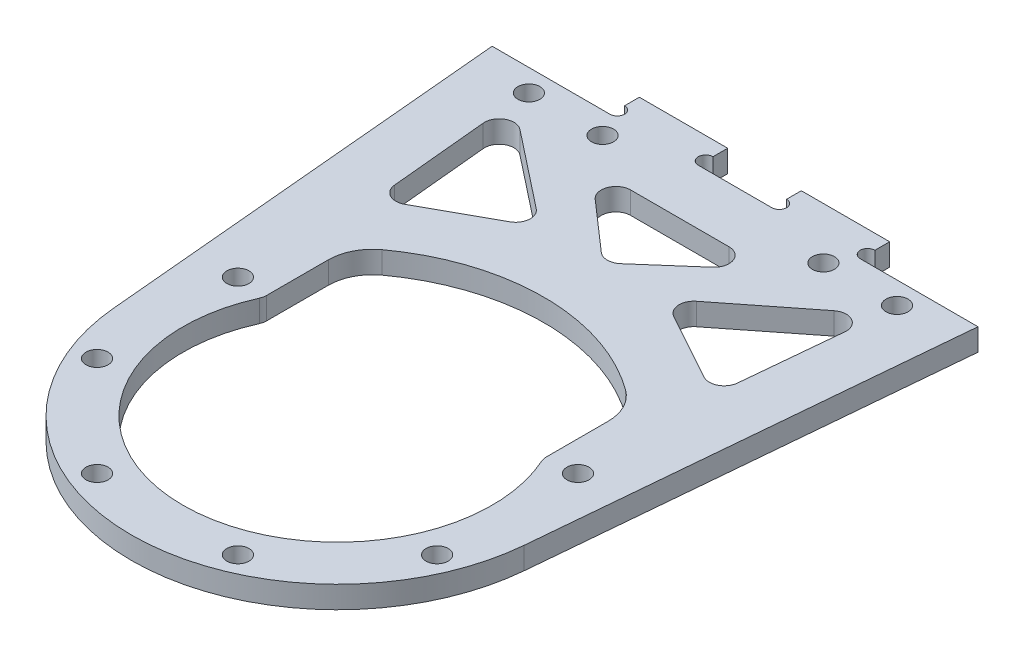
ISO-10303-21;
HEADER;
FILE_DESCRIPTION(('STEP AP214'),'2;1');
FILE_NAME('part.step','',(''),(''),'','','');
FILE_SCHEMA(('AUTOMOTIVE_DESIGN { 1 0 10303 214 1 1 1 1 }'));
ENDSEC;
DATA;
#1=APPLICATION_CONTEXT('core data for automotive mechanical design processes');
#2=APPLICATION_PROTOCOL_DEFINITION('international standard','automotive_design',2000,#1);
#3=PRODUCT_CONTEXT('',#1,'mechanical');
#4=PRODUCT('Part','Part','',(#3));
#5=PRODUCT_RELATED_PRODUCT_CATEGORY('part','',(#4));
#6=PRODUCT_DEFINITION_FORMATION('','',#4);
#7=PRODUCT_DEFINITION_CONTEXT('part definition',#1,'design');
#8=PRODUCT_DEFINITION('design','',#6,#7);
#9=PRODUCT_DEFINITION_SHAPE('','',#8);
#10=(LENGTH_UNIT() NAMED_UNIT(*) SI_UNIT(.MILLI.,.METRE.));
#11=(NAMED_UNIT(*) PLANE_ANGLE_UNIT() SI_UNIT($,.RADIAN.));
#12=(NAMED_UNIT(*) SI_UNIT($,.STERADIAN.) SOLID_ANGLE_UNIT());
#13=UNCERTAINTY_MEASURE_WITH_UNIT(LENGTH_MEASURE(1.E-05),#10,'distance_accuracy_value','');
#14=(GEOMETRIC_REPRESENTATION_CONTEXT(3) GLOBAL_UNCERTAINTY_ASSIGNED_CONTEXT((#13)) GLOBAL_UNIT_ASSIGNED_CONTEXT((#10,
#11,#12)) REPRESENTATION_CONTEXT('',''));
#15=CARTESIAN_POINT('',(0.,0.,0.));
#16=DIRECTION('',(0.,0.,1.));
#17=DIRECTION('',(1.,0.,0.));
#18=AXIS2_PLACEMENT_3D('',#15,#16,#17);
#19=CARTESIAN_POINT('',(0.,3.,0.));
#20=DIRECTION('',(0.,1.,0.));
#21=DIRECTION('',(0.,0.,1.));
#22=AXIS2_PLACEMENT_3D('',#19,#20,#21);
#23=PLANE('',#22);
#24=CARTESIAN_POINT('',(-25.,3.,-51.));
#25=DIRECTION('',(0.,1.,0.));
#26=DIRECTION('',(0.,0.,1.));
#27=AXIS2_PLACEMENT_3D('',#24,#25,#26);
#28=CIRCLE('',#27,1.5);
#29=CARTESIAN_POINT('',(-25.,3.,-49.5));
#30=VERTEX_POINT('',#29);
#31=EDGE_CURVE('E813',#30,#30,#28,.T.);
#32=ORIENTED_EDGE('',*,*,#31,.F.);
#33=EDGE_LOOP('',(#32));
#34=FACE_BOUND('',#33,.T.);
#35=CARTESIAN_POINT('',(15.,3.,-51.));
#36=DIRECTION('',(0.,1.,0.));
#37=DIRECTION('',(0.,0.,1.));
#38=AXIS2_PLACEMENT_3D('',#35,#36,#37);
#39=CIRCLE('',#38,1.5);
#40=CARTESIAN_POINT('',(15.,3.,-49.5));
#41=VERTEX_POINT('',#40);
#42=EDGE_CURVE('E818',#41,#41,#39,.T.);
#43=ORIENTED_EDGE('',*,*,#42,.F.);
#44=EDGE_LOOP('',(#43));
#45=FACE_BOUND('',#44,.T.);
#46=CARTESIAN_POINT('',(25.,3.,-51.));
#47=DIRECTION('',(0.,1.,0.));
#48=DIRECTION('',(0.,0.,1.));
#49=AXIS2_PLACEMENT_3D('',#46,#47,#48);
#50=CIRCLE('',#49,1.5);
#51=CARTESIAN_POINT('',(25.,3.,-49.5));
#52=VERTEX_POINT('',#51);
#53=EDGE_CURVE('E833',#52,#52,#50,.T.);
#54=ORIENTED_EDGE('',*,*,#53,.F.);
#55=EDGE_LOOP('',(#54));
#56=FACE_BOUND('',#55,.T.);
#57=CARTESIAN_POINT('',(-15.,3.,-51.));
#58=DIRECTION('',(0.,1.,0.));
#59=DIRECTION('',(0.,0.,1.));
#60=AXIS2_PLACEMENT_3D('',#57,#58,#59);
#61=CIRCLE('',#60,1.5);
#62=CARTESIAN_POINT('',(-15.,3.,-49.5));
#63=VERTEX_POINT('',#62);
#64=EDGE_CURVE('E817',#63,#63,#61,.T.);
#65=ORIENTED_EDGE('',*,*,#64,.F.);
#66=EDGE_LOOP('',(#65));
#67=FACE_BOUND('',#66,.T.);
#68=CARTESIAN_POINT('',(17.,3.,-55.));
#69=DIRECTION('',(0.,1.,0.));
#70=DIRECTION('',(0.,0.,1.));
#71=AXIS2_PLACEMENT_3D('',#68,#69,#70);
#72=CIRCLE('',#71,1.);
#73=CARTESIAN_POINT('',(17.,3.,-56.));
#74=VERTEX_POINT('',#73);
#75=CARTESIAN_POINT('',(17.,3.,-54.));
#76=VERTEX_POINT('',#75);
#77=EDGE_CURVE('E849',#74,#76,#72,.T.);
#78=ORIENTED_EDGE('',*,*,#77,.F.);
#79=DIRECTION('',(0.,0.,-1.));
#80=VECTOR('',#79,1.);
#81=CARTESIAN_POINT('',(17.,3.,-54.));
#82=LINE('',#81,#80);
#83=CARTESIAN_POINT('',(17.,3.,-58.));
#84=VERTEX_POINT('',#83);
#85=EDGE_CURVE('E876',#74,#84,#82,.T.);
#86=ORIENTED_EDGE('',*,*,#85,.T.);
#87=DIRECTION('',(-1.,0.,0.));
#88=VECTOR('',#87,1.);
#89=CARTESIAN_POINT('',(17.,3.,-58.));
#90=LINE('',#89,#88);
#91=CARTESIAN_POINT('',(5.,3.,-58.));
#92=VERTEX_POINT('',#91);
#93=EDGE_CURVE('E872',#84,#92,#90,.T.);
#94=ORIENTED_EDGE('',*,*,#93,.T.);
#95=DIRECTION('',(0.,0.,1.));
#96=VECTOR('',#95,1.);
#97=CARTESIAN_POINT('',(5.,3.,-54.));
#98=LINE('',#97,#96);
#99=CARTESIAN_POINT('',(5.,3.,-56.));
#100=VERTEX_POINT('',#99);
#101=EDGE_CURVE('E419',#92,#100,#98,.T.);
#102=ORIENTED_EDGE('',*,*,#101,.T.);
#103=CARTESIAN_POINT('',(5.,3.,-55.));
#104=DIRECTION('',(0.,1.,0.));
#105=DIRECTION('',(0.,0.,1.));
#106=AXIS2_PLACEMENT_3D('',#103,#104,#105);
#107=CIRCLE('',#106,1.);
#108=CARTESIAN_POINT('',(5.,3.,-54.));
#109=VERTEX_POINT('',#108);
#110=EDGE_CURVE('E398',#109,#100,#107,.T.);
#111=ORIENTED_EDGE('',*,*,#110,.F.);
#112=DIRECTION('',(1.,0.,0.));
#113=VECTOR('',#112,1.);
#114=CARTESIAN_POINT('',(0.,3.,-54.));
#115=LINE('',#114,#113);
#116=CARTESIAN_POINT('',(-5.,3.,-54.));
#117=VERTEX_POINT('',#116);
#118=EDGE_CURVE('E416',#117,#109,#115,.T.);
#119=ORIENTED_EDGE('',*,*,#118,.F.);
#120=CARTESIAN_POINT('',(-5.,3.,-55.));
#121=DIRECTION('',(0.,1.,0.));
#122=DIRECTION('',(0.,0.,1.));
#123=AXIS2_PLACEMENT_3D('',#120,#121,#122);
#124=CIRCLE('',#123,1.);
#125=CARTESIAN_POINT('',(-5.,3.,-56.));
#126=VERTEX_POINT('',#125);
#127=EDGE_CURVE('E421',#126,#117,#124,.T.);
#128=ORIENTED_EDGE('',*,*,#127,.F.);
#129=DIRECTION('',(0.,0.,-1.));
#130=VECTOR('',#129,1.);
#131=CARTESIAN_POINT('',(-5.,3.,-54.));
#132=LINE('',#131,#130);
#133=CARTESIAN_POINT('',(-5.,3.,-58.));
#134=VERTEX_POINT('',#133);
#135=EDGE_CURVE('E905',#126,#134,#132,.T.);
#136=ORIENTED_EDGE('',*,*,#135,.T.);
#137=DIRECTION('',(-1.,0.,0.));
#138=VECTOR('',#137,1.);
#139=CARTESIAN_POINT('',(-17.,3.,-58.));
#140=LINE('',#139,#138);
#141=CARTESIAN_POINT('',(-17.,3.,-58.));
#142=VERTEX_POINT('',#141);
#143=EDGE_CURVE('E894',#134,#142,#140,.T.);
#144=ORIENTED_EDGE('',*,*,#143,.T.);
#145=DIRECTION('',(0.,0.,1.));
#146=VECTOR('',#145,1.);
#147=CARTESIAN_POINT('',(-17.,3.,-54.));
#148=LINE('',#147,#146);
#149=CARTESIAN_POINT('',(-17.,3.,-56.));
#150=VERTEX_POINT('',#149);
#151=EDGE_CURVE('E879',#142,#150,#148,.T.);
#152=ORIENTED_EDGE('',*,*,#151,.T.);
#153=CARTESIAN_POINT('',(-17.,3.,-55.));
#154=DIRECTION('',(0.,1.,0.));
#155=DIRECTION('',(0.,0.,1.));
#156=AXIS2_PLACEMENT_3D('',#153,#154,#155);
#157=CIRCLE('',#156,1.);
#158=CARTESIAN_POINT('',(-17.,3.,-54.));
#159=VERTEX_POINT('',#158);
#160=EDGE_CURVE('E842',#159,#150,#157,.T.);
#161=ORIENTED_EDGE('',*,*,#160,.F.);
#162=CARTESIAN_POINT('',(-33.,3.,-54.));
#163=VERTEX_POINT('',#162);
#164=EDGE_CURVE('E427',#163,#159,#115,.T.);
#165=ORIENTED_EDGE('',*,*,#164,.F.);
#166=DIRECTION('',(0.0901066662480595,0.,0.995932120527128));
#167=VECTOR('',#166,1.);
#168=CARTESIAN_POINT('',(-27.8860993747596,3.,2.52298665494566));
#169=LINE('',#168,#167);
#170=CARTESIAN_POINT('',(-27.8860993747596,3.,2.52298665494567));
#171=VERTEX_POINT('',#170);
#172=EDGE_CURVE('E435',#163,#171,#169,.T.);
#173=ORIENTED_EDGE('',*,*,#172,.T.);
#174=CARTESIAN_POINT('',(0.,3.,0.));
#175=DIRECTION('',(0.,1.,0.));
#176=DIRECTION('',(0.,0.,1.));
#177=AXIS2_PLACEMENT_3D('',#174,#175,#176);
#178=CIRCLE('',#177,28.);
#179=CARTESIAN_POINT('',(27.8860993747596,3.,2.52298665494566));
#180=VERTEX_POINT('',#179);
#181=EDGE_CURVE('E516',#171,#180,#178,.T.);
#182=ORIENTED_EDGE('',*,*,#181,.T.);
#183=DIRECTION('',(-0.0901066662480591,0.,0.995932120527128));
#184=VECTOR('',#183,1.);
#185=CARTESIAN_POINT('',(27.8860993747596,3.,2.52298665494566));
#186=LINE('',#185,#184);
#187=CARTESIAN_POINT('',(33.,3.,-54.));
#188=VERTEX_POINT('',#187);
#189=EDGE_CURVE('E437',#188,#180,#186,.T.);
#190=ORIENTED_EDGE('',*,*,#189,.F.);
#191=EDGE_CURVE('E428',#76,#188,#115,.T.);
#192=ORIENTED_EDGE('',*,*,#191,.F.);
#193=EDGE_LOOP('',(#78,#86,#94,#102,#111,#119,#128,#136,#144,#152,#161,#165,#173,#182,#190,#192));
#194=FACE_BOUND('',#193,.T.);
#195=CARTESIAN_POINT('',(23.0969883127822,3.,9.56708580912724));
#196=DIRECTION('',(0.,1.,0.));
#197=DIRECTION('',(0.,0.,1.));
#198=AXIS2_PLACEMENT_3D('',#195,#196,#197);
#199=CIRCLE('',#198,1.5);
#200=CARTESIAN_POINT('',(23.0969883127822,3.,11.0670858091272));
#201=VERTEX_POINT('',#200);
#202=EDGE_CURVE('E477',#201,#201,#199,.T.);
#203=ORIENTED_EDGE('',*,*,#202,.F.);
#204=EDGE_LOOP('',(#203));
#205=FACE_BOUND('',#204,.T.);
#206=CARTESIAN_POINT('',(-23.0969883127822,3.,-9.56708580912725));
#207=DIRECTION('',(0.,1.,0.));
#208=DIRECTION('',(0.,0.,1.));
#209=AXIS2_PLACEMENT_3D('',#206,#207,#208);
#210=CIRCLE('',#209,1.5);
#211=CARTESIAN_POINT('',(-23.0969883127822,3.,-8.06708580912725));
#212=VERTEX_POINT('',#211);
#213=EDGE_CURVE('E493',#212,#212,#210,.T.);
#214=ORIENTED_EDGE('',*,*,#213,.F.);
#215=EDGE_LOOP('',(#214));
#216=FACE_BOUND('',#215,.T.);
#217=CARTESIAN_POINT('',(-9.56708580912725,3.,23.0969883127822));
#218=DIRECTION('',(0.,1.,0.));
#219=DIRECTION('',(0.,0.,1.));
#220=AXIS2_PLACEMENT_3D('',#217,#218,#219);
#221=CIRCLE('',#220,1.5);
#222=CARTESIAN_POINT('',(-9.56708580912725,3.,24.5969883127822));
#223=VERTEX_POINT('',#222);
#224=EDGE_CURVE('E508',#223,#223,#221,.T.);
#225=ORIENTED_EDGE('',*,*,#224,.F.);
#226=EDGE_LOOP('',(#225));
#227=FACE_BOUND('',#226,.T.);
#228=CARTESIAN_POINT('',(-23.0969883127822,3.,9.56708580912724));
#229=DIRECTION('',(0.,1.,0.));
#230=DIRECTION('',(0.,0.,1.));
#231=AXIS2_PLACEMENT_3D('',#228,#229,#230);
#232=CIRCLE('',#231,1.5);
#233=CARTESIAN_POINT('',(-23.0969883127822,3.,11.0670858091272));
#234=VERTEX_POINT('',#233);
#235=EDGE_CURVE('E501',#234,#234,#232,.T.);
#236=ORIENTED_EDGE('',*,*,#235,.F.);
#237=EDGE_LOOP('',(#236));
#238=FACE_BOUND('',#237,.T.);
#239=CARTESIAN_POINT('',(23.0969883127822,3.,-9.56708580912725));
#240=DIRECTION('',(0.,1.,0.));
#241=DIRECTION('',(0.,0.,1.));
#242=AXIS2_PLACEMENT_3D('',#239,#240,#241);
#243=CIRCLE('',#242,1.5);
#244=CARTESIAN_POINT('',(23.0969883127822,3.,-8.06708580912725));
#245=VERTEX_POINT('',#244);
#246=EDGE_CURVE('E485',#245,#245,#243,.T.);
#247=ORIENTED_EDGE('',*,*,#246,.F.);
#248=EDGE_LOOP('',(#247));
#249=FACE_BOUND('',#248,.T.);
#250=CARTESIAN_POINT('',(9.56708580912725,3.,23.0969883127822));
#251=DIRECTION('',(0.,1.,0.));
#252=DIRECTION('',(0.,0.,1.));
#253=AXIS2_PLACEMENT_3D('',#250,#251,#252);
#254=CIRCLE('',#253,1.5);
#255=CARTESIAN_POINT('',(9.56708580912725,3.,24.5969883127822));
#256=VERTEX_POINT('',#255);
#257=EDGE_CURVE('E469',#256,#256,#254,.T.);
#258=ORIENTED_EDGE('',*,*,#257,.F.);
#259=EDGE_LOOP('',(#258));
#260=FACE_BOUND('',#259,.T.);
#261=DIRECTION('',(1.,0.,0.));
#262=VECTOR('',#261,1.);
#263=CARTESIAN_POINT('',(0.,3.,-46.5));
#264=LINE('',#263,#262);
#265=CARTESIAN_POINT('',(-6.67710119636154,3.,-46.5));
#266=VERTEX_POINT('',#265);
#267=CARTESIAN_POINT('',(6.67710119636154,3.,-46.5));
#268=VERTEX_POINT('',#267);
#269=EDGE_CURVE('E789',#266,#268,#264,.T.);
#270=ORIENTED_EDGE('',*,*,#269,.T.);
#271=CARTESIAN_POINT('',(6.67710119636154,3.,-44.5));
#272=DIRECTION('',(0.,1.,0.));
#273=DIRECTION('',(0.,0.,1.));
#274=AXIS2_PLACEMENT_3D('',#271,#272,#273);
#275=CIRCLE('',#274,2.);
#276=CARTESIAN_POINT('',(7.99411041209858,3.,-42.9948466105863));
#277=VERTEX_POINT('',#276);
#278=EDGE_CURVE('E632',#268,#277,#275,.F.);
#279=ORIENTED_EDGE('',*,*,#278,.T.);
#280=DIRECTION('',(-0.752576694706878,0.,0.658504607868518));
#281=VECTOR('',#280,1.);
#282=CARTESIAN_POINT('',(-17.8407079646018,3.,-20.3893805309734));
#283=LINE('',#282,#281);
#284=CARTESIAN_POINT('',(1.31700921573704,3.,-37.1523830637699));
#285=VERTEX_POINT('',#284);
#286=EDGE_CURVE('E801',#277,#285,#283,.T.);
#287=ORIENTED_EDGE('',*,*,#286,.T.);
#288=CARTESIAN_POINT('',(0.,3.,-38.6575364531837));
#289=DIRECTION('',(0.,1.,0.));
#290=DIRECTION('',(0.,0.,1.));
#291=AXIS2_PLACEMENT_3D('',#288,#289,#290);
#292=CIRCLE('',#291,2.);
#293=CARTESIAN_POINT('',(-1.31700921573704,3.,-37.1523830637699));
#294=VERTEX_POINT('',#293);
#295=EDGE_CURVE('E626',#285,#294,#292,.F.);
#296=ORIENTED_EDGE('',*,*,#295,.T.);
#297=DIRECTION('',(-0.752576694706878,0.,-0.658504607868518));
#298=VECTOR('',#297,1.);
#299=CARTESIAN_POINT('',(17.8407079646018,3.,-20.3893805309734));
#300=LINE('',#299,#298);
#301=CARTESIAN_POINT('',(-7.99411041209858,3.,-42.9948466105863));
#302=VERTEX_POINT('',#301);
#303=EDGE_CURVE('E753',#294,#302,#300,.T.);
#304=ORIENTED_EDGE('',*,*,#303,.T.);
#305=CARTESIAN_POINT('',(-6.67710119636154,3.,-44.5));
#306=DIRECTION('',(0.,1.,0.));
#307=DIRECTION('',(0.,0.,1.));
#308=AXIS2_PLACEMENT_3D('',#305,#306,#307);
#309=CIRCLE('',#308,2.);
#310=EDGE_CURVE('E674',#302,#266,#309,.F.);
#311=ORIENTED_EDGE('',*,*,#310,.T.);
#312=EDGE_LOOP('',(#270,#279,#287,#296,#304,#311));
#313=FACE_BOUND('',#312,.T.);
#314=CARTESIAN_POINT('',(0.,3.,0.));
#315=DIRECTION('',(0.,1.,0.));
#316=DIRECTION('',(0.,0.,1.));
#317=AXIS2_PLACEMENT_3D('',#314,#315,#316);
#318=CIRCLE('',#317,28.);
#319=CARTESIAN_POINT('',(16.5454545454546,3.,-22.588668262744));
#320=VERTEX_POINT('',#319);
#321=CARTESIAN_POINT('',(-16.5454545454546,3.,-22.588668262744));
#322=VERTEX_POINT('',#321);
#323=EDGE_CURVE('E706',#320,#322,#318,.T.);
#324=ORIENTED_EDGE('',*,*,#323,.F.);
#325=CARTESIAN_POINT('',(13.,3.,-17.7482393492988));
#326=DIRECTION('',(0.,1.,0.));
#327=DIRECTION('',(0.,0.,1.));
#328=AXIS2_PLACEMENT_3D('',#325,#326,#327);
#329=CIRCLE('',#328,6.);
#330=CARTESIAN_POINT('',(19.,3.,-17.7482393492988));
#331=VERTEX_POINT('',#330);
#332=EDGE_CURVE('E693',#320,#331,#329,.F.);
#333=ORIENTED_EDGE('',*,*,#332,.T.);
#334=DIRECTION('',(0.,0.,1.));
#335=VECTOR('',#334,1.);
#336=CARTESIAN_POINT('',(19.,3.,0.));
#337=LINE('',#336,#335);
#338=CARTESIAN_POINT('',(19.,3.,-9.38083151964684));
#339=VERTEX_POINT('',#338);
#340=EDGE_CURVE('E713',#331,#339,#337,.T.);
#341=ORIENTED_EDGE('',*,*,#340,.T.);
#342=CARTESIAN_POINT('',(21.,3.,-9.38083151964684));
#343=DIRECTION('',(0.,1.,0.));
#344=DIRECTION('',(0.,0.,1.));
#345=AXIS2_PLACEMENT_3D('',#342,#343,#344);
#346=CIRCLE('',#345,2.);
#347=CARTESIAN_POINT('',(19.1739130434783,3.,-8.56510703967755));
#348=VERTEX_POINT('',#347);
#349=EDGE_CURVE('E543',#339,#348,#346,.T.);
#350=ORIENTED_EDGE('',*,*,#349,.T.);
#351=CARTESIAN_POINT('',(0.,3.,0.));
#352=DIRECTION('',(0.,1.,0.));
#353=DIRECTION('',(0.,0.,1.));
#354=AXIS2_PLACEMENT_3D('',#351,#352,#353);
#355=CIRCLE('',#354,21.);
#356=CARTESIAN_POINT('',(-19.1739130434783,3.,-8.56510703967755));
#357=VERTEX_POINT('',#356);
#358=EDGE_CURVE('E464',#357,#348,#355,.T.);
#359=ORIENTED_EDGE('',*,*,#358,.F.);
#360=CARTESIAN_POINT('',(-21.,3.,-9.38083151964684));
#361=DIRECTION('',(0.,1.,0.));
#362=DIRECTION('',(0.,0.,1.));
#363=AXIS2_PLACEMENT_3D('',#360,#361,#362);
#364=CIRCLE('',#363,2.);
#365=CARTESIAN_POINT('',(-19.,3.,-9.38083151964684));
#366=VERTEX_POINT('',#365);
#367=EDGE_CURVE('E539',#357,#366,#364,.T.);
#368=ORIENTED_EDGE('',*,*,#367,.T.);
#369=DIRECTION('',(0.,0.,1.));
#370=VECTOR('',#369,1.);
#371=CARTESIAN_POINT('',(-19.,3.,0.));
#372=LINE('',#371,#370);
#373=CARTESIAN_POINT('',(-19.,3.,-17.7482393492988));
#374=VERTEX_POINT('',#373);
#375=EDGE_CURVE('E707',#374,#366,#372,.T.);
#376=ORIENTED_EDGE('',*,*,#375,.F.);
#377=CARTESIAN_POINT('',(-13.,3.,-17.7482393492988));
#378=DIRECTION('',(0.,1.,0.));
#379=DIRECTION('',(0.,0.,1.));
#380=AXIS2_PLACEMENT_3D('',#377,#378,#379);
#381=CIRCLE('',#380,6.);
#382=EDGE_CURVE('E136',#374,#322,#381,.F.);
#383=ORIENTED_EDGE('',*,*,#382,.T.);
#384=EDGE_LOOP('',(#324,#333,#341,#350,#359,#368,#376,#383));
#385=FACE_BOUND('',#384,.T.);
#386=DIRECTION('',(-0.0948090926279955,0.,0.995495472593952));
#387=VECTOR('',#386,1.);
#388=CARTESIAN_POINT('',(20.1505617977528,3.,1.91910112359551));
#389=LINE('',#388,#387);
#390=CARTESIAN_POINT('',(24.5567957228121,3.,-44.3463550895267));
#391=VERTEX_POINT('',#390);
#392=CARTESIAN_POINT('',(23.2889201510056,3.,-31.0336615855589));
#393=VERTEX_POINT('',#392);
#394=EDGE_CURVE('E771',#391,#393,#389,.T.);
#395=ORIENTED_EDGE('',*,*,#394,.T.);
#396=CARTESIAN_POINT('',(21.2979292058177,3.,-31.2232797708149));
#397=DIRECTION('',(0.,1.,0.));
#398=DIRECTION('',(0.,0.,1.));
#399=AXIS2_PLACEMENT_3D('',#396,#397,#398);
#400=CIRCLE('',#399,2.);
#401=CARTESIAN_POINT('',(20.331774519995,3.,-29.4721244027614));
#402=VERTEX_POINT('',#401);
#403=EDGE_CURVE('E644',#393,#402,#400,.F.);
#404=ORIENTED_EDGE('',*,*,#403,.T.);
#405=DIRECTION('',(-0.875577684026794,0.,-0.483077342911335));
#406=VECTOR('',#405,1.);
#407=CARTESIAN_POINT('',(17.2105742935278,3.,-31.1941659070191));
#408=LINE('',#407,#406);
#409=CARTESIAN_POINT('',(11.1396766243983,3.,-34.5436266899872));
#410=VERTEX_POINT('',#409);
#411=EDGE_CURVE('E729',#402,#410,#408,.T.);
#412=ORIENTED_EDGE('',*,*,#411,.T.);
#413=CARTESIAN_POINT('',(12.1058313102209,3.,-36.2947820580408));
#414=DIRECTION('',(0.,1.,0.));
#415=DIRECTION('',(0.,0.,1.));
#416=AXIS2_PLACEMENT_3D('',#413,#414,#415);
#417=CIRCLE('',#416,2.);
#418=CARTESIAN_POINT('',(10.8680868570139,3.,-37.8657654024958));
#419=VERTEX_POINT('',#418);
#420=EDGE_CURVE('E638',#410,#419,#417,.F.);
#421=ORIENTED_EDGE('',*,*,#420,.T.);
#422=DIRECTION('',(0.785491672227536,0.,-0.618872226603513));
#423=VECTOR('',#422,1.);
#424=CARTESIAN_POINT('',(-14.2447592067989,3.,-18.0798866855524));
#425=LINE('',#424,#423);
#426=CARTESIAN_POINT('',(21.3280603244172,3.,-46.1069566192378));
#427=VERTEX_POINT('',#426);
#428=EDGE_CURVE('E721',#419,#427,#425,.T.);
#429=ORIENTED_EDGE('',*,*,#428,.T.);
#430=CARTESIAN_POINT('',(22.5658047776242,3.,-44.5359732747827));
#431=DIRECTION('',(0.,1.,0.));
#432=DIRECTION('',(0.,0.,1.));
#433=AXIS2_PLACEMENT_3D('',#430,#431,#432);
#434=CIRCLE('',#433,2.);
#435=EDGE_CURVE('E650',#427,#391,#434,.F.);
#436=ORIENTED_EDGE('',*,*,#435,.T.);
#437=EDGE_LOOP('',(#395,#404,#412,#421,#429,#436));
#438=FACE_BOUND('',#437,.T.);
#439=DIRECTION('',(0.785491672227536,0.,0.618872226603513));
#440=VECTOR('',#439,1.);
#441=CARTESIAN_POINT('',(14.2447592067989,3.,-18.0798866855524));
#442=LINE('',#441,#440);
#443=CARTESIAN_POINT('',(-21.3280603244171,3.,-46.1069566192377));
#444=VERTEX_POINT('',#443);
#445=CARTESIAN_POINT('',(-10.8680868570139,3.,-37.8657654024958));
#446=VERTEX_POINT('',#445);
#447=EDGE_CURVE('E745',#444,#446,#442,.T.);
#448=ORIENTED_EDGE('',*,*,#447,.T.);
#449=CARTESIAN_POINT('',(-12.1058313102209,3.,-36.2947820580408));
#450=DIRECTION('',(0.,1.,0.));
#451=DIRECTION('',(0.,0.,1.));
#452=AXIS2_PLACEMENT_3D('',#449,#450,#451);
#453=CIRCLE('',#452,2.);
#454=CARTESIAN_POINT('',(-11.1396766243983,3.,-34.5436266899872));
#455=VERTEX_POINT('',#454);
#456=EDGE_CURVE('E662',#446,#455,#453,.F.);
#457=ORIENTED_EDGE('',*,*,#456,.T.);
#458=DIRECTION('',(-0.875577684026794,0.,0.483077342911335));
#459=VECTOR('',#458,1.);
#460=CARTESIAN_POINT('',(-17.2105742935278,3.,-31.1941659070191));
#461=LINE('',#460,#459);
#462=CARTESIAN_POINT('',(-20.331774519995,3.,-29.4721244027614));
#463=VERTEX_POINT('',#462);
#464=EDGE_CURVE('E758',#455,#463,#461,.T.);
#465=ORIENTED_EDGE('',*,*,#464,.T.);
#466=CARTESIAN_POINT('',(-21.2979292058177,3.,-31.2232797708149));
#467=DIRECTION('',(0.,1.,0.));
#468=DIRECTION('',(0.,0.,1.));
#469=AXIS2_PLACEMENT_3D('',#466,#467,#468);
#470=CIRCLE('',#469,2.);
#471=CARTESIAN_POINT('',(-23.2889201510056,3.,-31.033661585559));
#472=VERTEX_POINT('',#471);
#473=EDGE_CURVE('E656',#463,#472,#470,.F.);
#474=ORIENTED_EDGE('',*,*,#473,.T.);
#475=DIRECTION('',(-0.0948090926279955,0.,-0.995495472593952));
#476=VECTOR('',#475,1.);
#477=CARTESIAN_POINT('',(-20.1505617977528,3.,1.91910112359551));
#478=LINE('',#477,#476);
#479=CARTESIAN_POINT('',(-24.5567957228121,3.,-44.3463550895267));
#480=VERTEX_POINT('',#479);
#481=EDGE_CURVE('E754',#472,#480,#478,.T.);
#482=ORIENTED_EDGE('',*,*,#481,.T.);
#483=CARTESIAN_POINT('',(-22.5658047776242,3.,-44.5359732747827));
#484=DIRECTION('',(0.,1.,0.));
#485=DIRECTION('',(0.,0.,1.));
#486=AXIS2_PLACEMENT_3D('',#483,#484,#485);
#487=CIRCLE('',#486,2.);
#488=EDGE_CURVE('E668',#480,#444,#487,.F.);
#489=ORIENTED_EDGE('',*,*,#488,.T.);
#490=EDGE_LOOP('',(#448,#457,#465,#474,#482,#489));
#491=FACE_BOUND('',#490,.T.);
#492=ADVANCED_FACE('F127',(#34,#45,#56,#67,#194,#205,#216,#227,#238,#249,#260,#313,#385,#438,
#491),#23,.T.);
#493=CARTESIAN_POINT('',(0.,0.,0.));
#494=DIRECTION('',(0.,1.,0.));
#495=DIRECTION('',(0.,0.,1.));
#496=AXIS2_PLACEMENT_3D('',#493,#494,#495);
#497=PLANE('',#496);
#498=DIRECTION('',(0.785491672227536,0.,-0.618872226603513));
#499=VECTOR('',#498,1.);
#500=CARTESIAN_POINT('',(-14.2447592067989,0.,-18.0798866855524));
#501=LINE('',#500,#499);
#502=CARTESIAN_POINT('',(10.8680868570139,0.,-37.8657654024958));
#503=VERTEX_POINT('',#502);
#504=CARTESIAN_POINT('',(21.3280603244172,0.,-46.1069566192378));
#505=VERTEX_POINT('',#504);
#506=EDGE_CURVE('E766',#503,#505,#501,.T.);
#507=ORIENTED_EDGE('',*,*,#506,.F.);
#508=CARTESIAN_POINT('',(12.1058313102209,0.,-36.2947820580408));
#509=DIRECTION('',(0.,1.,0.));
#510=DIRECTION('',(0.,0.,1.));
#511=AXIS2_PLACEMENT_3D('',#508,#509,#510);
#512=CIRCLE('',#511,2.);
#513=CARTESIAN_POINT('',(11.1396766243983,0.,-34.5436266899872));
#514=VERTEX_POINT('',#513);
#515=EDGE_CURVE('E641',#503,#514,#512,.T.);
#516=ORIENTED_EDGE('',*,*,#515,.T.);
#517=DIRECTION('',(-0.875577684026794,0.,-0.483077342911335));
#518=VECTOR('',#517,1.);
#519=CARTESIAN_POINT('',(17.2105742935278,0.,-31.1941659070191));
#520=LINE('',#519,#518);
#521=CARTESIAN_POINT('',(20.331774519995,0.,-29.4721244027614));
#522=VERTEX_POINT('',#521);
#523=EDGE_CURVE('E770',#522,#514,#520,.T.);
#524=ORIENTED_EDGE('',*,*,#523,.F.);
#525=CARTESIAN_POINT('',(21.2979292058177,0.,-31.2232797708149));
#526=DIRECTION('',(0.,1.,0.));
#527=DIRECTION('',(0.,0.,1.));
#528=AXIS2_PLACEMENT_3D('',#525,#526,#527);
#529=CIRCLE('',#528,2.);
#530=CARTESIAN_POINT('',(23.2889201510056,0.,-31.0336615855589));
#531=VERTEX_POINT('',#530);
#532=EDGE_CURVE('E647',#522,#531,#529,.T.);
#533=ORIENTED_EDGE('',*,*,#532,.T.);
#534=DIRECTION('',(-0.0948090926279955,0.,0.995495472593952));
#535=VECTOR('',#534,1.);
#536=CARTESIAN_POINT('',(20.1505617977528,0.,1.91910112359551));
#537=LINE('',#536,#535);
#538=CARTESIAN_POINT('',(24.5567957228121,0.,-44.3463550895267));
#539=VERTEX_POINT('',#538);
#540=EDGE_CURVE('E759',#539,#531,#537,.T.);
#541=ORIENTED_EDGE('',*,*,#540,.F.);
#542=CARTESIAN_POINT('',(22.5658047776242,0.,-44.5359732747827));
#543=DIRECTION('',(0.,1.,0.));
#544=DIRECTION('',(0.,0.,1.));
#545=AXIS2_PLACEMENT_3D('',#542,#543,#544);
#546=CIRCLE('',#545,2.);
#547=EDGE_CURVE('E653',#539,#505,#546,.T.);
#548=ORIENTED_EDGE('',*,*,#547,.T.);
#549=EDGE_LOOP('',(#507,#516,#524,#533,#541,#548));
#550=FACE_BOUND('',#549,.T.);
#551=DIRECTION('',(-0.752576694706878,0.,-0.658504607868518));
#552=VECTOR('',#551,1.);
#553=CARTESIAN_POINT('',(17.8407079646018,0.,-20.3893805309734));
#554=LINE('',#553,#552);
#555=CARTESIAN_POINT('',(-1.31700921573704,0.,-37.1523830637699));
#556=VERTEX_POINT('',#555);
#557=CARTESIAN_POINT('',(-7.99411041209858,0.,-42.9948466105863));
#558=VERTEX_POINT('',#557);
#559=EDGE_CURVE('E784',#556,#558,#554,.T.);
#560=ORIENTED_EDGE('',*,*,#559,.F.);
#561=CARTESIAN_POINT('',(0.,0.,-38.6575364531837));
#562=DIRECTION('',(0.,1.,0.));
#563=DIRECTION('',(0.,0.,1.));
#564=AXIS2_PLACEMENT_3D('',#561,#562,#563);
#565=CIRCLE('',#564,2.);
#566=CARTESIAN_POINT('',(1.31700921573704,0.,-37.1523830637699));
#567=VERTEX_POINT('',#566);
#568=EDGE_CURVE('E629',#556,#567,#565,.T.);
#569=ORIENTED_EDGE('',*,*,#568,.T.);
#570=DIRECTION('',(-0.752576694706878,0.,0.658504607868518));
#571=VECTOR('',#570,1.);
#572=CARTESIAN_POINT('',(-17.8407079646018,0.,-20.3893805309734));
#573=LINE('',#572,#571);
#574=CARTESIAN_POINT('',(7.99411041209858,0.,-42.9948466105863));
#575=VERTEX_POINT('',#574);
#576=EDGE_CURVE('E788',#575,#567,#573,.T.);
#577=ORIENTED_EDGE('',*,*,#576,.F.);
#578=CARTESIAN_POINT('',(6.67710119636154,0.,-44.5));
#579=DIRECTION('',(0.,1.,0.));
#580=DIRECTION('',(0.,0.,1.));
#581=AXIS2_PLACEMENT_3D('',#578,#579,#580);
#582=CIRCLE('',#581,2.);
#583=CARTESIAN_POINT('',(6.67710119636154,0.,-46.5));
#584=VERTEX_POINT('',#583);
#585=EDGE_CURVE('E635',#575,#584,#582,.T.);
#586=ORIENTED_EDGE('',*,*,#585,.T.);
#587=DIRECTION('',(1.,0.,0.));
#588=VECTOR('',#587,1.);
#589=CARTESIAN_POINT('',(0.,0.,-46.5));
#590=LINE('',#589,#588);
#591=CARTESIAN_POINT('',(-6.67710119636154,0.,-46.5));
#592=VERTEX_POINT('',#591);
#593=EDGE_CURVE('E793',#592,#584,#590,.T.);
#594=ORIENTED_EDGE('',*,*,#593,.F.);
#595=CARTESIAN_POINT('',(-6.67710119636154,0.,-44.5));
#596=DIRECTION('',(0.,1.,0.));
#597=DIRECTION('',(0.,0.,1.));
#598=AXIS2_PLACEMENT_3D('',#595,#596,#597);
#599=CIRCLE('',#598,2.);
#600=EDGE_CURVE('E677',#592,#558,#599,.T.);
#601=ORIENTED_EDGE('',*,*,#600,.T.);
#602=EDGE_LOOP('',(#560,#569,#577,#586,#594,#601));
#603=FACE_BOUND('',#602,.T.);
#604=CARTESIAN_POINT('',(-25.,0.,-51.));
#605=DIRECTION('',(0.,1.,0.));
#606=DIRECTION('',(0.,0.,1.));
#607=AXIS2_PLACEMENT_3D('',#604,#605,#606);
#608=CIRCLE('',#607,1.5);
#609=CARTESIAN_POINT('',(-25.,0.,-49.5));
#610=VERTEX_POINT('',#609);
#611=EDGE_CURVE('E808',#610,#610,#608,.T.);
#612=ORIENTED_EDGE('',*,*,#611,.T.);
#613=EDGE_LOOP('',(#612));
#614=FACE_BOUND('',#613,.T.);
#615=CARTESIAN_POINT('',(15.,0.,-51.));
#616=DIRECTION('',(0.,1.,0.));
#617=DIRECTION('',(0.,0.,1.));
#618=AXIS2_PLACEMENT_3D('',#615,#616,#617);
#619=CIRCLE('',#618,1.5);
#620=CARTESIAN_POINT('',(15.,0.,-49.5));
#621=VERTEX_POINT('',#620);
#622=EDGE_CURVE('E797',#621,#621,#619,.T.);
#623=ORIENTED_EDGE('',*,*,#622,.T.);
#624=EDGE_LOOP('',(#623));
#625=FACE_BOUND('',#624,.T.);
#626=CARTESIAN_POINT('',(25.,0.,-51.));
#627=DIRECTION('',(0.,1.,0.));
#628=DIRECTION('',(0.,0.,1.));
#629=AXIS2_PLACEMENT_3D('',#626,#627,#628);
#630=CIRCLE('',#629,1.5);
#631=CARTESIAN_POINT('',(25.,0.,-49.5));
#632=VERTEX_POINT('',#631);
#633=EDGE_CURVE('E822',#632,#632,#630,.T.);
#634=ORIENTED_EDGE('',*,*,#633,.T.);
#635=EDGE_LOOP('',(#634));
#636=FACE_BOUND('',#635,.T.);
#637=CARTESIAN_POINT('',(-15.,0.,-51.));
#638=DIRECTION('',(0.,1.,0.));
#639=DIRECTION('',(0.,0.,1.));
#640=AXIS2_PLACEMENT_3D('',#637,#638,#639);
#641=CIRCLE('',#640,1.5);
#642=CARTESIAN_POINT('',(-15.,0.,-49.5));
#643=VERTEX_POINT('',#642);
#644=EDGE_CURVE('E829',#643,#643,#641,.T.);
#645=ORIENTED_EDGE('',*,*,#644,.T.);
#646=EDGE_LOOP('',(#645));
#647=FACE_BOUND('',#646,.T.);
#648=DIRECTION('',(0.,0.,-1.));
#649=VECTOR('',#648,1.);
#650=CARTESIAN_POINT('',(17.,0.,-54.));
#651=LINE('',#650,#649);
#652=CARTESIAN_POINT('',(17.,0.,-56.));
#653=VERTEX_POINT('',#652);
#654=CARTESIAN_POINT('',(17.,0.,-58.));
#655=VERTEX_POINT('',#654);
#656=EDGE_CURVE('E873',#653,#655,#651,.T.);
#657=ORIENTED_EDGE('',*,*,#656,.F.);
#658=CARTESIAN_POINT('',(17.,0.,-55.));
#659=DIRECTION('',(0.,1.,0.));
#660=DIRECTION('',(0.,0.,1.));
#661=AXIS2_PLACEMENT_3D('',#658,#659,#660);
#662=CIRCLE('',#661,1.);
#663=CARTESIAN_POINT('',(17.,0.,-54.));
#664=VERTEX_POINT('',#663);
#665=EDGE_CURVE('E812',#653,#664,#662,.T.);
#666=ORIENTED_EDGE('',*,*,#665,.T.);
#667=DIRECTION('',(1.,0.,0.));
#668=VECTOR('',#667,1.);
#669=CARTESIAN_POINT('',(0.,0.,-54.));
#670=LINE('',#669,#668);
#671=CARTESIAN_POINT('',(33.,0.,-54.));
#672=VERTEX_POINT('',#671);
#673=EDGE_CURVE('E924',#664,#672,#670,.T.);
#674=ORIENTED_EDGE('',*,*,#673,.T.);
#675=DIRECTION('',(-0.0901066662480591,0.,0.995932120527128));
#676=VECTOR('',#675,1.);
#677=CARTESIAN_POINT('',(27.8860993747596,0.,2.52298665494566));
#678=LINE('',#677,#676);
#679=CARTESIAN_POINT('',(27.8860993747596,0.,2.52298665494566));
#680=VERTEX_POINT('',#679);
#681=EDGE_CURVE('E443',#672,#680,#678,.T.);
#682=ORIENTED_EDGE('',*,*,#681,.T.);
#683=CARTESIAN_POINT('',(0.,0.,0.));
#684=DIRECTION('',(0.,1.,0.));
#685=DIRECTION('',(0.,0.,1.));
#686=AXIS2_PLACEMENT_3D('',#683,#684,#685);
#687=CIRCLE('',#686,28.);
#688=CARTESIAN_POINT('',(-27.8860993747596,0.,2.52298665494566));
#689=VERTEX_POINT('',#688);
#690=EDGE_CURVE('E512',#689,#680,#687,.T.);
#691=ORIENTED_EDGE('',*,*,#690,.F.);
#692=DIRECTION('',(0.0901066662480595,0.,0.995932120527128));
#693=VECTOR('',#692,1.);
#694=CARTESIAN_POINT('',(-27.8860993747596,0.,2.52298665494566));
#695=LINE('',#694,#693);
#696=CARTESIAN_POINT('',(-33.,0.,-54.));
#697=VERTEX_POINT('',#696);
#698=EDGE_CURVE('E460',#697,#689,#695,.T.);
#699=ORIENTED_EDGE('',*,*,#698,.F.);
#700=CARTESIAN_POINT('',(-17.,0.,-54.));
#701=VERTEX_POINT('',#700);
#702=EDGE_CURVE('E925',#697,#701,#670,.T.);
#703=ORIENTED_EDGE('',*,*,#702,.T.);
#704=CARTESIAN_POINT('',(-17.,0.,-55.));
#705=DIRECTION('',(0.,1.,0.));
#706=DIRECTION('',(0.,0.,1.));
#707=AXIS2_PLACEMENT_3D('',#704,#705,#706);
#708=CIRCLE('',#707,1.);
#709=CARTESIAN_POINT('',(-17.,0.,-56.));
#710=VERTEX_POINT('',#709);
#711=EDGE_CURVE('E845',#701,#710,#708,.T.);
#712=ORIENTED_EDGE('',*,*,#711,.T.);
#713=DIRECTION('',(0.,0.,1.));
#714=VECTOR('',#713,1.);
#715=CARTESIAN_POINT('',(-17.,0.,-54.));
#716=LINE('',#715,#714);
#717=CARTESIAN_POINT('',(-17.,0.,-58.));
#718=VERTEX_POINT('',#717);
#719=EDGE_CURVE('E889',#718,#710,#716,.T.);
#720=ORIENTED_EDGE('',*,*,#719,.F.);
#721=DIRECTION('',(-1.,0.,0.));
#722=VECTOR('',#721,1.);
#723=CARTESIAN_POINT('',(-17.,0.,-58.));
#724=LINE('',#723,#722);
#725=CARTESIAN_POINT('',(-5.,0.,-58.));
#726=VERTEX_POINT('',#725);
#727=EDGE_CURVE('E897',#726,#718,#724,.T.);
#728=ORIENTED_EDGE('',*,*,#727,.F.);
#729=DIRECTION('',(0.,0.,-1.));
#730=VECTOR('',#729,1.);
#731=CARTESIAN_POINT('',(-5.,0.,-54.));
#732=LINE('',#731,#730);
#733=CARTESIAN_POINT('',(-5.,0.,-56.));
#734=VERTEX_POINT('',#733);
#735=EDGE_CURVE('E893',#734,#726,#732,.T.);
#736=ORIENTED_EDGE('',*,*,#735,.F.);
#737=CARTESIAN_POINT('',(-5.,0.,-55.));
#738=DIRECTION('',(0.,1.,0.));
#739=DIRECTION('',(0.,0.,1.));
#740=AXIS2_PLACEMENT_3D('',#737,#738,#739);
#741=CIRCLE('',#740,1.);
#742=CARTESIAN_POINT('',(-5.,0.,-54.));
#743=VERTEX_POINT('',#742);
#744=EDGE_CURVE('E855',#734,#743,#741,.T.);
#745=ORIENTED_EDGE('',*,*,#744,.T.);
#746=CARTESIAN_POINT('',(5.,0.,-54.));
#747=VERTEX_POINT('',#746);
#748=EDGE_CURVE('E928',#743,#747,#670,.T.);
#749=ORIENTED_EDGE('',*,*,#748,.T.);
#750=CARTESIAN_POINT('',(5.,0.,-55.));
#751=DIRECTION('',(0.,1.,0.));
#752=DIRECTION('',(0.,0.,1.));
#753=AXIS2_PLACEMENT_3D('',#750,#751,#752);
#754=CIRCLE('',#753,1.);
#755=CARTESIAN_POINT('',(5.,0.,-56.));
#756=VERTEX_POINT('',#755);
#757=EDGE_CURVE('E401',#747,#756,#754,.T.);
#758=ORIENTED_EDGE('',*,*,#757,.T.);
#759=DIRECTION('',(0.,0.,1.));
#760=VECTOR('',#759,1.);
#761=CARTESIAN_POINT('',(5.,0.,-54.));
#762=LINE('',#761,#760);
#763=CARTESIAN_POINT('',(5.,0.,-58.));
#764=VERTEX_POINT('',#763);
#765=EDGE_CURVE('E865',#764,#756,#762,.T.);
#766=ORIENTED_EDGE('',*,*,#765,.F.);
#767=DIRECTION('',(-1.,0.,0.));
#768=VECTOR('',#767,1.);
#769=CARTESIAN_POINT('',(17.,0.,-58.));
#770=LINE('',#769,#768);
#771=EDGE_CURVE('E883',#655,#764,#770,.T.);
#772=ORIENTED_EDGE('',*,*,#771,.F.);
#773=EDGE_LOOP('',(#657,#666,#674,#682,#691,#699,#703,#712,#720,#728,#736,#745,#749,#758,#766,#772));
#774=FACE_BOUND('',#773,.T.);
#775=CARTESIAN_POINT('',(-9.56708580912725,0.,23.0969883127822));
#776=DIRECTION('',(0.,1.,0.));
#777=DIRECTION('',(0.,0.,1.));
#778=AXIS2_PLACEMENT_3D('',#775,#776,#777);
#779=CIRCLE('',#778,1.5);
#780=CARTESIAN_POINT('',(-9.56708580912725,0.,24.5969883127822));
#781=VERTEX_POINT('',#780);
#782=EDGE_CURVE('E504',#781,#781,#779,.T.);
#783=ORIENTED_EDGE('',*,*,#782,.T.);
#784=EDGE_LOOP('',(#783));
#785=FACE_BOUND('',#784,.T.);
#786=CARTESIAN_POINT('',(-23.0969883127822,0.,9.56708580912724));
#787=DIRECTION('',(0.,1.,0.));
#788=DIRECTION('',(0.,0.,1.));
#789=AXIS2_PLACEMENT_3D('',#786,#787,#788);
#790=CIRCLE('',#789,1.5);
#791=CARTESIAN_POINT('',(-23.0969883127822,0.,11.0670858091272));
#792=VERTEX_POINT('',#791);
#793=EDGE_CURVE('E497',#792,#792,#790,.T.);
#794=ORIENTED_EDGE('',*,*,#793,.T.);
#795=EDGE_LOOP('',(#794));
#796=FACE_BOUND('',#795,.T.);
#797=CARTESIAN_POINT('',(-23.0969883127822,0.,-9.56708580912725));
#798=DIRECTION('',(0.,1.,0.));
#799=DIRECTION('',(0.,0.,1.));
#800=AXIS2_PLACEMENT_3D('',#797,#798,#799);
#801=CIRCLE('',#800,1.5);
#802=CARTESIAN_POINT('',(-23.0969883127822,0.,-8.06708580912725));
#803=VERTEX_POINT('',#802);
#804=EDGE_CURVE('E489',#803,#803,#801,.T.);
#805=ORIENTED_EDGE('',*,*,#804,.T.);
#806=EDGE_LOOP('',(#805));
#807=FACE_BOUND('',#806,.T.);
#808=CARTESIAN_POINT('',(23.0969883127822,0.,-9.56708580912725));
#809=DIRECTION('',(0.,1.,0.));
#810=DIRECTION('',(0.,0.,1.));
#811=AXIS2_PLACEMENT_3D('',#808,#809,#810);
#812=CIRCLE('',#811,1.5);
#813=CARTESIAN_POINT('',(23.0969883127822,0.,-8.06708580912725));
#814=VERTEX_POINT('',#813);
#815=EDGE_CURVE('E481',#814,#814,#812,.T.);
#816=ORIENTED_EDGE('',*,*,#815,.T.);
#817=EDGE_LOOP('',(#816));
#818=FACE_BOUND('',#817,.T.);
#819=CARTESIAN_POINT('',(23.0969883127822,0.,9.56708580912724));
#820=DIRECTION('',(0.,1.,0.));
#821=DIRECTION('',(0.,0.,1.));
#822=AXIS2_PLACEMENT_3D('',#819,#820,#821);
#823=CIRCLE('',#822,1.5);
#824=CARTESIAN_POINT('',(23.0969883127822,0.,11.0670858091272));
#825=VERTEX_POINT('',#824);
#826=EDGE_CURVE('E473',#825,#825,#823,.T.);
#827=ORIENTED_EDGE('',*,*,#826,.T.);
#828=EDGE_LOOP('',(#827));
#829=FACE_BOUND('',#828,.T.);
#830=CARTESIAN_POINT('',(9.56708580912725,0.,23.0969883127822));
#831=DIRECTION('',(0.,1.,0.));
#832=DIRECTION('',(0.,0.,1.));
#833=AXIS2_PLACEMENT_3D('',#830,#831,#832);
#834=CIRCLE('',#833,1.5);
#835=CARTESIAN_POINT('',(9.56708580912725,0.,24.5969883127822));
#836=VERTEX_POINT('',#835);
#837=EDGE_CURVE('E468',#836,#836,#834,.T.);
#838=ORIENTED_EDGE('',*,*,#837,.T.);
#839=EDGE_LOOP('',(#838));
#840=FACE_BOUND('',#839,.T.);
#841=CARTESIAN_POINT('',(0.,0.,0.));
#842=DIRECTION('',(0.,-1.,0.));
#843=DIRECTION('',(0.,0.,-1.));
#844=AXIS2_PLACEMENT_3D('',#841,#842,#843);
#845=CIRCLE('',#844,21.);
#846=CARTESIAN_POINT('',(19.1739130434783,0.,-8.56510703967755));
#847=VERTEX_POINT('',#846);
#848=CARTESIAN_POINT('',(-19.1739130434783,0.,-8.56510703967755));
#849=VERTEX_POINT('',#848);
#850=EDGE_CURVE('E448',#847,#849,#845,.T.);
#851=ORIENTED_EDGE('',*,*,#850,.F.);
#852=CARTESIAN_POINT('',(21.,0.,-9.38083151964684));
#853=DIRECTION('',(0.,1.,0.));
#854=DIRECTION('',(0.,0.,1.));
#855=AXIS2_PLACEMENT_3D('',#852,#853,#854);
#856=CIRCLE('',#855,2.);
#857=CARTESIAN_POINT('',(19.,0.,-9.38083151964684));
#858=VERTEX_POINT('',#857);
#859=EDGE_CURVE('E556',#847,#858,#856,.F.);
#860=ORIENTED_EDGE('',*,*,#859,.T.);
#861=DIRECTION('',(0.,0.,1.));
#862=VECTOR('',#861,1.);
#863=CARTESIAN_POINT('',(19.,0.,0.));
#864=LINE('',#863,#862);
#865=CARTESIAN_POINT('',(19.,0.,-17.7482393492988));
#866=VERTEX_POINT('',#865);
#867=EDGE_CURVE('E732',#866,#858,#864,.T.);
#868=ORIENTED_EDGE('',*,*,#867,.F.);
#869=CARTESIAN_POINT('',(13.,0.,-17.7482393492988));
#870=DIRECTION('',(0.,1.,0.));
#871=DIRECTION('',(0.,0.,1.));
#872=AXIS2_PLACEMENT_3D('',#869,#870,#871);
#873=CIRCLE('',#872,6.);
#874=CARTESIAN_POINT('',(16.5454545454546,0.,-22.588668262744));
#875=VERTEX_POINT('',#874);
#876=EDGE_CURVE('E696',#866,#875,#873,.T.);
#877=ORIENTED_EDGE('',*,*,#876,.T.);
#878=CARTESIAN_POINT('',(0.,0.,0.));
#879=DIRECTION('',(0.,1.,0.));
#880=DIRECTION('',(0.,0.,1.));
#881=AXIS2_PLACEMENT_3D('',#878,#879,#880);
#882=CIRCLE('',#881,28.);
#883=CARTESIAN_POINT('',(-16.5454545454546,0.,-22.588668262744));
#884=VERTEX_POINT('',#883);
#885=EDGE_CURVE('E722',#875,#884,#882,.T.);
#886=ORIENTED_EDGE('',*,*,#885,.T.);
#887=CARTESIAN_POINT('',(-13.,0.,-17.7482393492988));
#888=DIRECTION('',(0.,1.,0.));
#889=DIRECTION('',(0.,0.,1.));
#890=AXIS2_PLACEMENT_3D('',#887,#888,#889);
#891=CIRCLE('',#890,6.);
#892=CARTESIAN_POINT('',(-19.,0.,-17.7482393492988));
#893=VERTEX_POINT('',#892);
#894=EDGE_CURVE('E12',#884,#893,#891,.T.);
#895=ORIENTED_EDGE('',*,*,#894,.T.);
#896=DIRECTION('',(0.,0.,1.));
#897=VECTOR('',#896,1.);
#898=CARTESIAN_POINT('',(-19.,0.,0.));
#899=LINE('',#898,#897);
#900=CARTESIAN_POINT('',(-19.,0.,-9.38083151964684));
#901=VERTEX_POINT('',#900);
#902=EDGE_CURVE('E717',#893,#901,#899,.T.);
#903=ORIENTED_EDGE('',*,*,#902,.T.);
#904=CARTESIAN_POINT('',(-21.,0.,-9.38083151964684));
#905=DIRECTION('',(0.,1.,0.));
#906=DIRECTION('',(0.,0.,1.));
#907=AXIS2_PLACEMENT_3D('',#904,#905,#906);
#908=CIRCLE('',#907,2.);
#909=EDGE_CURVE('E553',#901,#849,#908,.F.);
#910=ORIENTED_EDGE('',*,*,#909,.T.);
#911=EDGE_LOOP('',(#851,#860,#868,#877,#886,#895,#903,#910));
#912=FACE_BOUND('',#911,.T.);
#913=DIRECTION('',(-0.0948090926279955,0.,-0.995495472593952));
#914=VECTOR('',#913,1.);
#915=CARTESIAN_POINT('',(-20.1505617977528,0.,1.91910112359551));
#916=LINE('',#915,#914);
#917=CARTESIAN_POINT('',(-23.2889201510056,0.,-31.033661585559));
#918=VERTEX_POINT('',#917);
#919=CARTESIAN_POINT('',(-24.5567957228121,0.,-44.3463550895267));
#920=VERTEX_POINT('',#919);
#921=EDGE_CURVE('E740',#918,#920,#916,.T.);
#922=ORIENTED_EDGE('',*,*,#921,.F.);
#923=CARTESIAN_POINT('',(-21.2979292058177,0.,-31.2232797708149));
#924=DIRECTION('',(0.,1.,0.));
#925=DIRECTION('',(0.,0.,1.));
#926=AXIS2_PLACEMENT_3D('',#923,#924,#925);
#927=CIRCLE('',#926,2.);
#928=CARTESIAN_POINT('',(-20.331774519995,0.,-29.4721244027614));
#929=VERTEX_POINT('',#928);
#930=EDGE_CURVE('E659',#918,#929,#927,.T.);
#931=ORIENTED_EDGE('',*,*,#930,.T.);
#932=DIRECTION('',(-0.875577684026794,0.,0.483077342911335));
#933=VECTOR('',#932,1.);
#934=CARTESIAN_POINT('',(-17.2105742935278,0.,-31.1941659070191));
#935=LINE('',#934,#933);
#936=CARTESIAN_POINT('',(-11.1396766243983,0.,-34.5436266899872));
#937=VERTEX_POINT('',#936);
#938=EDGE_CURVE('E744',#937,#929,#935,.T.);
#939=ORIENTED_EDGE('',*,*,#938,.F.);
#940=CARTESIAN_POINT('',(-12.1058313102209,0.,-36.2947820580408));
#941=DIRECTION('',(0.,1.,0.));
#942=DIRECTION('',(0.,0.,1.));
#943=AXIS2_PLACEMENT_3D('',#940,#941,#942);
#944=CIRCLE('',#943,2.);
#945=CARTESIAN_POINT('',(-10.8680868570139,0.,-37.8657654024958));
#946=VERTEX_POINT('',#945);
#947=EDGE_CURVE('E665',#937,#946,#944,.T.);
#948=ORIENTED_EDGE('',*,*,#947,.T.);
#949=DIRECTION('',(0.785491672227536,0.,0.618872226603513));
#950=VECTOR('',#949,1.);
#951=CARTESIAN_POINT('',(14.2447592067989,0.,-18.0798866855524));
#952=LINE('',#951,#950);
#953=CARTESIAN_POINT('',(-21.3280603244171,0.,-46.1069566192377));
#954=VERTEX_POINT('',#953);
#955=EDGE_CURVE('E749',#954,#946,#952,.T.);
#956=ORIENTED_EDGE('',*,*,#955,.F.);
#957=CARTESIAN_POINT('',(-22.5658047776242,0.,-44.5359732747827));
#958=DIRECTION('',(0.,1.,0.));
#959=DIRECTION('',(0.,0.,1.));
#960=AXIS2_PLACEMENT_3D('',#957,#958,#959);
#961=CIRCLE('',#960,2.);
#962=EDGE_CURVE('E671',#954,#920,#961,.T.);
#963=ORIENTED_EDGE('',*,*,#962,.T.);
#964=EDGE_LOOP('',(#922,#931,#939,#948,#956,#963));
#965=FACE_BOUND('',#964,.T.);
#966=ADVANCED_FACE('F942',(#550,#603,#614,#625,#636,#647,#774,#785,#796,#807,#818,#829,#840,
#912,#965),#497,.F.);
#967=CARTESIAN_POINT('',(0.,10.,0.));
#968=DIRECTION('',(0.,-1.,0.));
#969=DIRECTION('',(0.,0.,-1.));
#970=AXIS2_PLACEMENT_3D('',#967,#968,#969);
#971=CYLINDRICAL_SURFACE('',#970,21.);
#972=ORIENTED_EDGE('',*,*,#358,.T.);
#973=DIRECTION('',(0.,-1.,0.));
#974=VECTOR('',#973,1.);
#975=CARTESIAN_POINT('',(19.1739130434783,10.,-8.56510703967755));
#976=LINE('',#975,#974);
#977=EDGE_CURVE('E550',#348,#847,#976,.T.);
#978=ORIENTED_EDGE('',*,*,#977,.T.);
#979=ORIENTED_EDGE('',*,*,#850,.T.);
#980=DIRECTION('',(0.,-1.,0.));
#981=VECTOR('',#980,1.);
#982=CARTESIAN_POINT('',(-19.1739130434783,10.,-8.56510703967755));
#983=LINE('',#982,#981);
#984=EDGE_CURVE('E546',#849,#357,#983,.F.);
#985=ORIENTED_EDGE('',*,*,#984,.T.);
#986=EDGE_LOOP('',(#972,#978,#979,#985));
#987=FACE_BOUND('',#986,.T.);
#988=ADVANCED_FACE('F994',(#987),#971,.F.);
#989=CARTESIAN_POINT('',(0.,0.,-54.));
#990=DIRECTION('',(0.,0.,1.));
#991=DIRECTION('',(1.,0.,0.));
#992=AXIS2_PLACEMENT_3D('',#989,#990,#991);
#993=PLANE('',#992);
#994=ORIENTED_EDGE('',*,*,#673,.F.);
#995=DIRECTION('',(0.,1.,0.));
#996=VECTOR('',#995,1.);
#997=CARTESIAN_POINT('',(17.,0.,-54.));
#998=LINE('',#997,#996);
#999=EDGE_CURVE('E408',#664,#76,#998,.T.);
#1000=ORIENTED_EDGE('',*,*,#999,.T.);
#1001=ORIENTED_EDGE('',*,*,#191,.T.);
#1002=DIRECTION('',(0.,1.,0.));
#1003=VECTOR('',#1002,1.);
#1004=CARTESIAN_POINT('',(33.,0.,-54.));
#1005=LINE('',#1004,#1003);
#1006=EDGE_CURVE('E452',#672,#188,#1005,.T.);
#1007=ORIENTED_EDGE('',*,*,#1006,.F.);
#1008=EDGE_LOOP('',(#994,#1000,#1001,#1007));
#1009=FACE_BOUND('',#1008,.T.);
#1010=ADVANCED_FACE('F1221',(#1009),#993,.F.);
#1011=DIRECTION('',(0.,1.,0.));
#1012=VECTOR('',#1011,1.);
#1013=CARTESIAN_POINT('',(-17.,0.,-54.));
#1014=LINE('',#1013,#1012);
#1015=EDGE_CURVE('E901',#701,#159,#1014,.T.);
#1016=ORIENTED_EDGE('',*,*,#1015,.F.);
#1017=ORIENTED_EDGE('',*,*,#702,.F.);
#1018=DIRECTION('',(0.,1.,0.));
#1019=VECTOR('',#1018,1.);
#1020=CARTESIAN_POINT('',(-33.,0.,-54.));
#1021=LINE('',#1020,#1019);
#1022=EDGE_CURVE('E449',#697,#163,#1021,.T.);
#1023=ORIENTED_EDGE('',*,*,#1022,.T.);
#1024=ORIENTED_EDGE('',*,*,#164,.T.);
#1025=EDGE_LOOP('',(#1016,#1017,#1023,#1024));
#1026=FACE_BOUND('',#1025,.T.);
#1027=ADVANCED_FACE('F956',(#1026),#993,.F.);
#1028=CARTESIAN_POINT('',(0.,3.,0.));
#1029=DIRECTION('',(0.,-1.,0.));
#1030=DIRECTION('',(0.,0.,-1.));
#1031=AXIS2_PLACEMENT_3D('',#1028,#1029,#1030);
#1032=CYLINDRICAL_SURFACE('',#1031,28.);
#1033=ORIENTED_EDGE('',*,*,#181,.F.);
#1034=DIRECTION('',(0.,1.,0.));
#1035=VECTOR('',#1034,1.);
#1036=CARTESIAN_POINT('',(-27.8860993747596,0.,2.52298665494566));
#1037=LINE('',#1036,#1035);
#1038=EDGE_CURVE('E444',#689,#171,#1037,.T.);
#1039=ORIENTED_EDGE('',*,*,#1038,.F.);
#1040=ORIENTED_EDGE('',*,*,#690,.T.);
#1041=DIRECTION('',(0.,1.,0.));
#1042=VECTOR('',#1041,1.);
#1043=CARTESIAN_POINT('',(27.8860993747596,0.,2.52298665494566));
#1044=LINE('',#1043,#1042);
#1045=EDGE_CURVE('E456',#680,#180,#1044,.T.);
#1046=ORIENTED_EDGE('',*,*,#1045,.T.);
#1047=EDGE_LOOP('',(#1033,#1039,#1040,#1046));
#1048=FACE_BOUND('',#1047,.T.);
#1049=ADVANCED_FACE('F940',(#1048),#1032,.T.);
#1050=CARTESIAN_POINT('',(-9.56708580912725,3.,23.0969883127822));
#1051=DIRECTION('',(0.,-1.,0.));
#1052=DIRECTION('',(0.,0.,-1.));
#1053=AXIS2_PLACEMENT_3D('',#1050,#1051,#1052);
#1054=CYLINDRICAL_SURFACE('',#1053,1.5);
#1055=ORIENTED_EDGE('',*,*,#224,.T.);
#1056=EDGE_LOOP('',(#1055));
#1057=FACE_BOUND('',#1056,.T.);
#1058=ORIENTED_EDGE('',*,*,#782,.F.);
#1059=EDGE_LOOP('',(#1058));
#1060=FACE_BOUND('',#1059,.T.);
#1061=ADVANCED_FACE('F1000',(#1057,#1060),#1054,.F.);
#1062=CARTESIAN_POINT('',(-23.0969883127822,3.,9.56708580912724));
#1063=DIRECTION('',(0.,-1.,0.));
#1064=DIRECTION('',(0.,0.,-1.));
#1065=AXIS2_PLACEMENT_3D('',#1062,#1063,#1064);
#1066=CYLINDRICAL_SURFACE('',#1065,1.5);
#1067=ORIENTED_EDGE('',*,*,#235,.T.);
#1068=EDGE_LOOP('',(#1067));
#1069=FACE_BOUND('',#1068,.T.);
#1070=ORIENTED_EDGE('',*,*,#793,.F.);
#1071=EDGE_LOOP('',(#1070));
#1072=FACE_BOUND('',#1071,.T.);
#1073=ADVANCED_FACE('F1628',(#1069,#1072),#1066,.F.);
#1074=CARTESIAN_POINT('',(-23.0969883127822,3.,-9.56708580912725));
#1075=DIRECTION('',(0.,-1.,0.));
#1076=DIRECTION('',(0.,0.,-1.));
#1077=AXIS2_PLACEMENT_3D('',#1074,#1075,#1076);
#1078=CYLINDRICAL_SURFACE('',#1077,1.5);
#1079=ORIENTED_EDGE('',*,*,#213,.T.);
#1080=EDGE_LOOP('',(#1079));
#1081=FACE_BOUND('',#1080,.T.);
#1082=ORIENTED_EDGE('',*,*,#804,.F.);
#1083=EDGE_LOOP('',(#1082));
#1084=FACE_BOUND('',#1083,.T.);
#1085=ADVANCED_FACE('F1636',(#1081,#1084),#1078,.F.);
#1086=CARTESIAN_POINT('',(23.0969883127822,3.,-9.56708580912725));
#1087=DIRECTION('',(0.,-1.,0.));
#1088=DIRECTION('',(0.,0.,-1.));
#1089=AXIS2_PLACEMENT_3D('',#1086,#1087,#1088);
#1090=CYLINDRICAL_SURFACE('',#1089,1.5);
#1091=ORIENTED_EDGE('',*,*,#246,.T.);
#1092=EDGE_LOOP('',(#1091));
#1093=FACE_BOUND('',#1092,.T.);
#1094=ORIENTED_EDGE('',*,*,#815,.F.);
#1095=EDGE_LOOP('',(#1094));
#1096=FACE_BOUND('',#1095,.T.);
#1097=ADVANCED_FACE('F1644',(#1093,#1096),#1090,.F.);
#1098=CARTESIAN_POINT('',(23.0969883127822,3.,9.56708580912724));
#1099=DIRECTION('',(0.,-1.,0.));
#1100=DIRECTION('',(0.,0.,-1.));
#1101=AXIS2_PLACEMENT_3D('',#1098,#1099,#1100);
#1102=CYLINDRICAL_SURFACE('',#1101,1.5);
#1103=ORIENTED_EDGE('',*,*,#202,.T.);
#1104=EDGE_LOOP('',(#1103));
#1105=FACE_BOUND('',#1104,.T.);
#1106=ORIENTED_EDGE('',*,*,#826,.F.);
#1107=EDGE_LOOP('',(#1106));
#1108=FACE_BOUND('',#1107,.T.);
#1109=ADVANCED_FACE('F1241',(#1105,#1108),#1102,.F.);
#1110=CARTESIAN_POINT('',(9.56708580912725,3.,23.0969883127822));
#1111=DIRECTION('',(0.,-1.,0.));
#1112=DIRECTION('',(0.,0.,-1.));
#1113=AXIS2_PLACEMENT_3D('',#1110,#1111,#1112);
#1114=CYLINDRICAL_SURFACE('',#1113,1.5);
#1115=ORIENTED_EDGE('',*,*,#257,.T.);
#1116=EDGE_LOOP('',(#1115));
#1117=FACE_BOUND('',#1116,.T.);
#1118=ORIENTED_EDGE('',*,*,#837,.F.);
#1119=EDGE_LOOP('',(#1118));
#1120=FACE_BOUND('',#1119,.T.);
#1121=ADVANCED_FACE('F1237',(#1117,#1120),#1114,.F.);
#1122=CARTESIAN_POINT('',(-27.8860993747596,0.,2.52298665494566));
#1123=DIRECTION('',(-0.995932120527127,0.,0.0901066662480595));
#1124=DIRECTION('',(0.0901066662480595,0.,0.995932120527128));
#1125=AXIS2_PLACEMENT_3D('',#1122,#1123,#1124);
#1126=PLANE('',#1125);
#1127=ORIENTED_EDGE('',*,*,#172,.F.);
#1128=ORIENTED_EDGE('',*,*,#1022,.F.);
#1129=ORIENTED_EDGE('',*,*,#698,.T.);
#1130=ORIENTED_EDGE('',*,*,#1038,.T.);
#1131=EDGE_LOOP('',(#1127,#1128,#1129,#1130));
#1132=FACE_BOUND('',#1131,.T.);
#1133=ADVANCED_FACE('F934',(#1132),#1126,.T.);
#1134=ORIENTED_EDGE('',*,*,#118,.T.);
#1135=DIRECTION('',(0.,1.,0.));
#1136=VECTOR('',#1135,1.);
#1137=CARTESIAN_POINT('',(5.,0.,-54.));
#1138=LINE('',#1137,#1136);
#1139=EDGE_CURVE('E395',#747,#109,#1138,.T.);
#1140=ORIENTED_EDGE('',*,*,#1139,.F.);
#1141=ORIENTED_EDGE('',*,*,#748,.F.);
#1142=DIRECTION('',(0.,1.,0.));
#1143=VECTOR('',#1142,1.);
#1144=CARTESIAN_POINT('',(-5.,0.,-54.));
#1145=LINE('',#1144,#1143);
#1146=EDGE_CURVE('E425',#743,#117,#1145,.T.);
#1147=ORIENTED_EDGE('',*,*,#1146,.T.);
#1148=EDGE_LOOP('',(#1134,#1140,#1141,#1147));
#1149=FACE_BOUND('',#1148,.T.);
#1150=ADVANCED_FACE('F424',(#1149),#993,.F.);
#1151=CARTESIAN_POINT('',(27.8860993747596,0.,2.52298665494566));
#1152=DIRECTION('',(-0.995932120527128,0.,-0.0901066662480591));
#1153=DIRECTION('',(-0.0901066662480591,0.,0.995932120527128));
#1154=AXIS2_PLACEMENT_3D('',#1151,#1152,#1153);
#1155=PLANE('',#1154);
#1156=ORIENTED_EDGE('',*,*,#189,.T.);
#1157=ORIENTED_EDGE('',*,*,#1045,.F.);
#1158=ORIENTED_EDGE('',*,*,#681,.F.);
#1159=ORIENTED_EDGE('',*,*,#1006,.T.);
#1160=EDGE_LOOP('',(#1156,#1157,#1158,#1159));
#1161=FACE_BOUND('',#1160,.T.);
#1162=ADVANCED_FACE('F949',(#1161),#1155,.F.);
#1163=CARTESIAN_POINT('',(-17.,0.,-54.));
#1164=DIRECTION('',(-1.,0.,0.));
#1165=DIRECTION('',(0.,0.,1.));
#1166=AXIS2_PLACEMENT_3D('',#1163,#1164,#1165);
#1167=PLANE('',#1166);
#1168=DIRECTION('',(0.,1.,0.));
#1169=VECTOR('',#1168,1.);
#1170=CARTESIAN_POINT('',(-17.,0.,-56.));
#1171=LINE('',#1170,#1169);
#1172=EDGE_CURVE('E532',#150,#710,#1171,.F.);
#1173=ORIENTED_EDGE('',*,*,#1172,.F.);
#1174=ORIENTED_EDGE('',*,*,#151,.F.);
#1175=DIRECTION('',(0.,1.,0.));
#1176=VECTOR('',#1175,1.);
#1177=CARTESIAN_POINT('',(-17.,0.,-58.));
#1178=LINE('',#1177,#1176);
#1179=EDGE_CURVE('E911',#718,#142,#1178,.T.);
#1180=ORIENTED_EDGE('',*,*,#1179,.F.);
#1181=ORIENTED_EDGE('',*,*,#719,.T.);
#1182=EDGE_LOOP('',(#1173,#1174,#1180,#1181));
#1183=FACE_BOUND('',#1182,.T.);
#1184=ADVANCED_FACE('F962',(#1183),#1167,.T.);
#1185=CARTESIAN_POINT('',(-17.,0.,-58.));
#1186=DIRECTION('',(0.,0.,-1.));
#1187=DIRECTION('',(-1.,0.,0.));
#1188=AXIS2_PLACEMENT_3D('',#1185,#1186,#1187);
#1189=PLANE('',#1188);
#1190=ORIENTED_EDGE('',*,*,#143,.F.);
#1191=DIRECTION('',(0.,1.,0.));
#1192=VECTOR('',#1191,1.);
#1193=CARTESIAN_POINT('',(-5.,0.,-58.));
#1194=LINE('',#1193,#1192);
#1195=EDGE_CURVE('E914',#726,#134,#1194,.T.);
#1196=ORIENTED_EDGE('',*,*,#1195,.F.);
#1197=ORIENTED_EDGE('',*,*,#727,.T.);
#1198=ORIENTED_EDGE('',*,*,#1179,.T.);
#1199=EDGE_LOOP('',(#1190,#1196,#1197,#1198));
#1200=FACE_BOUND('',#1199,.T.);
#1201=ADVANCED_FACE('F966',(#1200),#1189,.T.);
#1202=CARTESIAN_POINT('',(-5.,0.,-54.));
#1203=DIRECTION('',(1.,0.,0.));
#1204=DIRECTION('',(0.,0.,-1.));
#1205=AXIS2_PLACEMENT_3D('',#1202,#1203,#1204);
#1206=PLANE('',#1205);
#1207=DIRECTION('',(0.,1.,0.));
#1208=VECTOR('',#1207,1.);
#1209=CARTESIAN_POINT('',(-5.,0.,-56.));
#1210=LINE('',#1209,#1208);
#1211=EDGE_CURVE('E529',#734,#126,#1210,.T.);
#1212=ORIENTED_EDGE('',*,*,#1211,.F.);
#1213=ORIENTED_EDGE('',*,*,#735,.T.);
#1214=ORIENTED_EDGE('',*,*,#1195,.T.);
#1215=ORIENTED_EDGE('',*,*,#135,.F.);
#1216=EDGE_LOOP('',(#1212,#1213,#1214,#1215));
#1217=FACE_BOUND('',#1216,.T.);
#1218=ADVANCED_FACE('F971',(#1217),#1206,.T.);
#1219=CARTESIAN_POINT('',(17.,0.,-54.));
#1220=DIRECTION('',(1.,0.,0.));
#1221=DIRECTION('',(0.,0.,-1.));
#1222=AXIS2_PLACEMENT_3D('',#1219,#1220,#1221);
#1223=PLANE('',#1222);
#1224=DIRECTION('',(0.,1.,0.));
#1225=VECTOR('',#1224,1.);
#1226=CARTESIAN_POINT('',(17.,0.,-56.));
#1227=LINE('',#1226,#1225);
#1228=EDGE_CURVE('E526',#653,#74,#1227,.T.);
#1229=ORIENTED_EDGE('',*,*,#1228,.F.);
#1230=ORIENTED_EDGE('',*,*,#656,.T.);
#1231=DIRECTION('',(0.,1.,0.));
#1232=VECTOR('',#1231,1.);
#1233=CARTESIAN_POINT('',(17.,0.,-58.));
#1234=LINE('',#1233,#1232);
#1235=EDGE_CURVE('E861',#655,#84,#1234,.T.);
#1236=ORIENTED_EDGE('',*,*,#1235,.T.);
#1237=ORIENTED_EDGE('',*,*,#85,.F.);
#1238=EDGE_LOOP('',(#1229,#1230,#1236,#1237));
#1239=FACE_BOUND('',#1238,.T.);
#1240=ADVANCED_FACE('F1218',(#1239),#1223,.T.);
#1241=CARTESIAN_POINT('',(5.,0.,-54.));
#1242=DIRECTION('',(-1.,0.,0.));
#1243=DIRECTION('',(0.,0.,1.));
#1244=AXIS2_PLACEMENT_3D('',#1241,#1242,#1243);
#1245=PLANE('',#1244);
#1246=DIRECTION('',(0.,1.,0.));
#1247=VECTOR('',#1246,1.);
#1248=CARTESIAN_POINT('',(5.,0.,-56.));
#1249=LINE('',#1248,#1247);
#1250=EDGE_CURVE('E520',#100,#756,#1249,.F.);
#1251=ORIENTED_EDGE('',*,*,#1250,.F.);
#1252=ORIENTED_EDGE('',*,*,#101,.F.);
#1253=DIRECTION('',(0.,1.,0.));
#1254=VECTOR('',#1253,1.);
#1255=CARTESIAN_POINT('',(5.,0.,-58.));
#1256=LINE('',#1255,#1254);
#1257=EDGE_CURVE('E407',#764,#92,#1256,.T.);
#1258=ORIENTED_EDGE('',*,*,#1257,.F.);
#1259=ORIENTED_EDGE('',*,*,#765,.T.);
#1260=EDGE_LOOP('',(#1251,#1252,#1258,#1259));
#1261=FACE_BOUND('',#1260,.T.);
#1262=ADVANCED_FACE('F1211',(#1261),#1245,.T.);
#1263=CARTESIAN_POINT('',(17.,0.,-58.));
#1264=DIRECTION('',(0.,0.,-1.));
#1265=DIRECTION('',(-1.,0.,0.));
#1266=AXIS2_PLACEMENT_3D('',#1263,#1264,#1265);
#1267=PLANE('',#1266);
#1268=ORIENTED_EDGE('',*,*,#93,.F.);
#1269=ORIENTED_EDGE('',*,*,#1235,.F.);
#1270=ORIENTED_EDGE('',*,*,#771,.T.);
#1271=ORIENTED_EDGE('',*,*,#1257,.T.);
#1272=EDGE_LOOP('',(#1268,#1269,#1270,#1271));
#1273=FACE_BOUND('',#1272,.T.);
#1274=ADVANCED_FACE('F1214',(#1273),#1267,.T.);
#1275=CARTESIAN_POINT('',(5.,0.,-55.));
#1276=DIRECTION('',(0.,1.,0.));
#1277=DIRECTION('',(0.,0.,1.));
#1278=AXIS2_PLACEMENT_3D('',#1275,#1276,#1277);
#1279=CYLINDRICAL_SURFACE('',#1278,1.);
#1280=ORIENTED_EDGE('',*,*,#1139,.T.);
#1281=ORIENTED_EDGE('',*,*,#110,.T.);
#1282=ORIENTED_EDGE('',*,*,#1250,.T.);
#1283=ORIENTED_EDGE('',*,*,#757,.F.);
#1284=EDGE_LOOP('',(#1280,#1281,#1282,#1283));
#1285=FACE_BOUND('',#1284,.T.);
#1286=ADVANCED_FACE('F397',(#1285),#1279,.F.);
#1287=CARTESIAN_POINT('',(17.,0.,-55.));
#1288=DIRECTION('',(0.,1.,0.));
#1289=DIRECTION('',(0.,0.,1.));
#1290=AXIS2_PLACEMENT_3D('',#1287,#1288,#1289);
#1291=CYLINDRICAL_SURFACE('',#1290,1.);
#1292=ORIENTED_EDGE('',*,*,#1228,.T.);
#1293=ORIENTED_EDGE('',*,*,#77,.T.);
#1294=ORIENTED_EDGE('',*,*,#999,.F.);
#1295=ORIENTED_EDGE('',*,*,#665,.F.);
#1296=EDGE_LOOP('',(#1292,#1293,#1294,#1295));
#1297=FACE_BOUND('',#1296,.T.);
#1298=ADVANCED_FACE('F977',(#1297),#1291,.F.);
#1299=CARTESIAN_POINT('',(-5.,0.,-55.));
#1300=DIRECTION('',(0.,1.,0.));
#1301=DIRECTION('',(0.,0.,1.));
#1302=AXIS2_PLACEMENT_3D('',#1299,#1300,#1301);
#1303=CYLINDRICAL_SURFACE('',#1302,1.);
#1304=ORIENTED_EDGE('',*,*,#1211,.T.);
#1305=ORIENTED_EDGE('',*,*,#127,.T.);
#1306=ORIENTED_EDGE('',*,*,#1146,.F.);
#1307=ORIENTED_EDGE('',*,*,#744,.F.);
#1308=EDGE_LOOP('',(#1304,#1305,#1306,#1307));
#1309=FACE_BOUND('',#1308,.T.);
#1310=ADVANCED_FACE('F974',(#1309),#1303,.F.);
#1311=CARTESIAN_POINT('',(-17.,0.,-55.));
#1312=DIRECTION('',(0.,1.,0.));
#1313=DIRECTION('',(0.,0.,1.));
#1314=AXIS2_PLACEMENT_3D('',#1311,#1312,#1313);
#1315=CYLINDRICAL_SURFACE('',#1314,1.);
#1316=ORIENTED_EDGE('',*,*,#1015,.T.);
#1317=ORIENTED_EDGE('',*,*,#160,.T.);
#1318=ORIENTED_EDGE('',*,*,#1172,.T.);
#1319=ORIENTED_EDGE('',*,*,#711,.F.);
#1320=EDGE_LOOP('',(#1316,#1317,#1318,#1319));
#1321=FACE_BOUND('',#1320,.T.);
#1322=ADVANCED_FACE('F976',(#1321),#1315,.F.);
#1323=CARTESIAN_POINT('',(-15.,0.,-51.));
#1324=DIRECTION('',(0.,1.,0.));
#1325=DIRECTION('',(0.,0.,1.));
#1326=AXIS2_PLACEMENT_3D('',#1323,#1324,#1325);
#1327=CYLINDRICAL_SURFACE('',#1326,1.5);
#1328=ORIENTED_EDGE('',*,*,#644,.F.);
#1329=EDGE_LOOP('',(#1328));
#1330=FACE_BOUND('',#1329,.T.);
#1331=ORIENTED_EDGE('',*,*,#64,.T.);
#1332=EDGE_LOOP('',(#1331));
#1333=FACE_BOUND('',#1332,.T.);
#1334=ADVANCED_FACE('F983',(#1330,#1333),#1327,.F.);
#1335=CARTESIAN_POINT('',(25.,0.,-51.));
#1336=DIRECTION('',(0.,1.,0.));
#1337=DIRECTION('',(0.,0.,1.));
#1338=AXIS2_PLACEMENT_3D('',#1335,#1336,#1337);
#1339=CYLINDRICAL_SURFACE('',#1338,1.5);
#1340=ORIENTED_EDGE('',*,*,#633,.F.);
#1341=EDGE_LOOP('',(#1340));
#1342=FACE_BOUND('',#1341,.T.);
#1343=ORIENTED_EDGE('',*,*,#53,.T.);
#1344=EDGE_LOOP('',(#1343));
#1345=FACE_BOUND('',#1344,.T.);
#1346=ADVANCED_FACE('F1288',(#1342,#1345),#1339,.F.);
#1347=CARTESIAN_POINT('',(15.,0.,-51.));
#1348=DIRECTION('',(0.,1.,0.));
#1349=DIRECTION('',(0.,0.,1.));
#1350=AXIS2_PLACEMENT_3D('',#1347,#1348,#1349);
#1351=CYLINDRICAL_SURFACE('',#1350,1.5);
#1352=ORIENTED_EDGE('',*,*,#622,.F.);
#1353=EDGE_LOOP('',(#1352));
#1354=FACE_BOUND('',#1353,.T.);
#1355=ORIENTED_EDGE('',*,*,#42,.T.);
#1356=EDGE_LOOP('',(#1355));
#1357=FACE_BOUND('',#1356,.T.);
#1358=ADVANCED_FACE('F1297',(#1354,#1357),#1351,.F.);
#1359=CARTESIAN_POINT('',(-25.,0.,-51.));
#1360=DIRECTION('',(0.,1.,0.));
#1361=DIRECTION('',(0.,0.,1.));
#1362=AXIS2_PLACEMENT_3D('',#1359,#1360,#1361);
#1363=CYLINDRICAL_SURFACE('',#1362,1.5);
#1364=ORIENTED_EDGE('',*,*,#611,.F.);
#1365=EDGE_LOOP('',(#1364));
#1366=FACE_BOUND('',#1365,.T.);
#1367=ORIENTED_EDGE('',*,*,#31,.T.);
#1368=EDGE_LOOP('',(#1367));
#1369=FACE_BOUND('',#1368,.T.);
#1370=ADVANCED_FACE('F1306',(#1366,#1369),#1363,.F.);
#1371=CARTESIAN_POINT('',(19.,0.,0.));
#1372=DIRECTION('',(-1.,0.,0.));
#1373=DIRECTION('',(0.,0.,1.));
#1374=AXIS2_PLACEMENT_3D('',#1371,#1372,#1373);
#1375=PLANE('',#1374);
#1376=ORIENTED_EDGE('',*,*,#340,.F.);
#1377=DIRECTION('',(0.,1.,0.));
#1378=VECTOR('',#1377,1.);
#1379=CARTESIAN_POINT('',(19.,0.,-17.7482393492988));
#1380=LINE('',#1379,#1378);
#1381=EDGE_CURVE('E687',#331,#866,#1380,.F.);
#1382=ORIENTED_EDGE('',*,*,#1381,.T.);
#1383=ORIENTED_EDGE('',*,*,#867,.T.);
#1384=DIRECTION('',(0.,1.,0.));
#1385=VECTOR('',#1384,1.);
#1386=CARTESIAN_POINT('',(19.,3.,-9.38083151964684));
#1387=LINE('',#1386,#1385);
#1388=EDGE_CURVE('E535',#858,#339,#1387,.T.);
#1389=ORIENTED_EDGE('',*,*,#1388,.T.);
#1390=EDGE_LOOP('',(#1376,#1382,#1383,#1389));
#1391=FACE_BOUND('',#1390,.T.);
#1392=ADVANCED_FACE('F1315',(#1391),#1375,.T.);
#1393=CARTESIAN_POINT('',(-19.,0.,0.));
#1394=DIRECTION('',(-1.,0.,0.));
#1395=DIRECTION('',(0.,0.,1.));
#1396=AXIS2_PLACEMENT_3D('',#1393,#1394,#1395);
#1397=PLANE('',#1396);
#1398=ORIENTED_EDGE('',*,*,#902,.F.);
#1399=DIRECTION('',(0.,-1.,0.));
#1400=VECTOR('',#1399,1.);
#1401=CARTESIAN_POINT('',(-19.,3.,-17.7482393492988));
#1402=LINE('',#1401,#1400);
#1403=EDGE_CURVE('E690',#893,#374,#1402,.F.);
#1404=ORIENTED_EDGE('',*,*,#1403,.T.);
#1405=ORIENTED_EDGE('',*,*,#375,.T.);
#1406=DIRECTION('',(0.,-1.,0.));
#1407=VECTOR('',#1406,1.);
#1408=CARTESIAN_POINT('',(-19.,0.,-9.38083151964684));
#1409=LINE('',#1408,#1407);
#1410=EDGE_CURVE('E560',#366,#901,#1409,.T.);
#1411=ORIENTED_EDGE('',*,*,#1410,.T.);
#1412=EDGE_LOOP('',(#1398,#1404,#1405,#1411));
#1413=FACE_BOUND('',#1412,.T.);
#1414=ADVANCED_FACE('F716',(#1413),#1397,.F.);
#1415=CARTESIAN_POINT('',(0.,0.,0.));
#1416=DIRECTION('',(0.,1.,0.));
#1417=DIRECTION('',(0.,0.,1.));
#1418=AXIS2_PLACEMENT_3D('',#1415,#1416,#1417);
#1419=CYLINDRICAL_SURFACE('',#1418,28.);
#1420=ORIENTED_EDGE('',*,*,#885,.F.);
#1421=DIRECTION('',(0.,1.,0.));
#1422=VECTOR('',#1421,1.);
#1423=CARTESIAN_POINT('',(16.5454545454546,0.,-22.588668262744));
#1424=LINE('',#1423,#1422);
#1425=EDGE_CURVE('E683',#875,#320,#1424,.T.);
#1426=ORIENTED_EDGE('',*,*,#1425,.T.);
#1427=ORIENTED_EDGE('',*,*,#323,.T.);
#1428=DIRECTION('',(0.,1.,0.));
#1429=VECTOR('',#1428,1.);
#1430=CARTESIAN_POINT('',(-16.5454545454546,0.,-22.588668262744));
#1431=LINE('',#1430,#1429);
#1432=EDGE_CURVE('E680',#322,#884,#1431,.F.);
#1433=ORIENTED_EDGE('',*,*,#1432,.T.);
#1434=EDGE_LOOP('',(#1420,#1426,#1427,#1433));
#1435=FACE_BOUND('',#1434,.T.);
#1436=ADVANCED_FACE('F710',(#1435),#1419,.F.);
#1437=CARTESIAN_POINT('',(17.8407079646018,0.,-20.3893805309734));
#1438=DIRECTION('',(0.658504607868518,0.,-0.752576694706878));
#1439=DIRECTION('',(-0.752576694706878,0.,-0.658504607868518));
#1440=AXIS2_PLACEMENT_3D('',#1437,#1438,#1439);
#1441=PLANE('',#1440);
#1442=ORIENTED_EDGE('',*,*,#303,.F.);
#1443=DIRECTION('',(0.,1.,0.));
#1444=VECTOR('',#1443,1.);
#1445=CARTESIAN_POINT('',(-1.31700921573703,0.,-37.1523830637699));
#1446=LINE('',#1445,#1444);
#1447=EDGE_CURVE('E575',#294,#556,#1446,.F.);
#1448=ORIENTED_EDGE('',*,*,#1447,.T.);
#1449=ORIENTED_EDGE('',*,*,#559,.T.);
#1450=DIRECTION('',(0.,1.,0.));
#1451=VECTOR('',#1450,1.);
#1452=CARTESIAN_POINT('',(-7.99411041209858,3.,-42.9948466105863));
#1453=LINE('',#1452,#1451);
#1454=EDGE_CURVE('E571',#558,#302,#1453,.T.);
#1455=ORIENTED_EDGE('',*,*,#1454,.T.);
#1456=EDGE_LOOP('',(#1442,#1448,#1449,#1455));
#1457=FACE_BOUND('',#1456,.T.);
#1458=ADVANCED_FACE('F1340',(#1457),#1441,.T.);
#1459=CARTESIAN_POINT('',(0.,0.,-46.5));
#1460=DIRECTION('',(0.,0.,1.));
#1461=DIRECTION('',(1.,0.,0.));
#1462=AXIS2_PLACEMENT_3D('',#1459,#1460,#1461);
#1463=PLANE('',#1462);
#1464=ORIENTED_EDGE('',*,*,#593,.T.);
#1465=DIRECTION('',(0.,1.,0.));
#1466=VECTOR('',#1465,1.);
#1467=CARTESIAN_POINT('',(6.67710119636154,3.,-46.5));
#1468=LINE('',#1467,#1466);
#1469=EDGE_CURVE('E581',#584,#268,#1468,.T.);
#1470=ORIENTED_EDGE('',*,*,#1469,.T.);
#1471=ORIENTED_EDGE('',*,*,#269,.F.);
#1472=DIRECTION('',(0.,1.,0.));
#1473=VECTOR('',#1472,1.);
#1474=CARTESIAN_POINT('',(-6.67710119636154,0.,-46.5));
#1475=LINE('',#1474,#1473);
#1476=EDGE_CURVE('E578',#266,#592,#1475,.F.);
#1477=ORIENTED_EDGE('',*,*,#1476,.T.);
#1478=EDGE_LOOP('',(#1464,#1470,#1471,#1477));
#1479=FACE_BOUND('',#1478,.T.);
#1480=ADVANCED_FACE('F1349',(#1479),#1463,.T.);
#1481=CARTESIAN_POINT('',(-17.8407079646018,0.,-20.3893805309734));
#1482=DIRECTION('',(-0.658504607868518,0.,-0.752576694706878));
#1483=DIRECTION('',(-0.752576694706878,0.,0.658504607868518));
#1484=AXIS2_PLACEMENT_3D('',#1481,#1482,#1483);
#1485=PLANE('',#1484);
#1486=ORIENTED_EDGE('',*,*,#576,.T.);
#1487=DIRECTION('',(0.,1.,0.));
#1488=VECTOR('',#1487,1.);
#1489=CARTESIAN_POINT('',(1.31700921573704,3.,-37.1523830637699));
#1490=LINE('',#1489,#1488);
#1491=EDGE_CURVE('E567',#567,#285,#1490,.T.);
#1492=ORIENTED_EDGE('',*,*,#1491,.T.);
#1493=ORIENTED_EDGE('',*,*,#286,.F.);
#1494=DIRECTION('',(0.,1.,0.));
#1495=VECTOR('',#1494,1.);
#1496=CARTESIAN_POINT('',(7.99411041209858,0.,-42.9948466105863));
#1497=LINE('',#1496,#1495);
#1498=EDGE_CURVE('E564',#277,#575,#1497,.F.);
#1499=ORIENTED_EDGE('',*,*,#1498,.T.);
#1500=EDGE_LOOP('',(#1486,#1492,#1493,#1499));
#1501=FACE_BOUND('',#1500,.T.);
#1502=ADVANCED_FACE('F1358',(#1501),#1485,.T.);
#1503=CARTESIAN_POINT('',(-14.2447592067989,0.,-18.0798866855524));
#1504=DIRECTION('',(0.618872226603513,0.,0.785491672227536));
#1505=DIRECTION('',(0.785491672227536,0.,-0.618872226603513));
#1506=AXIS2_PLACEMENT_3D('',#1503,#1504,#1505);
#1507=PLANE('',#1506);
#1508=ORIENTED_EDGE('',*,*,#428,.F.);
#1509=DIRECTION('',(0.,1.,0.));
#1510=VECTOR('',#1509,1.);
#1511=CARTESIAN_POINT('',(10.8680868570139,0.,-37.8657654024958));
#1512=LINE('',#1511,#1510);
#1513=EDGE_CURVE('E596',#419,#503,#1512,.F.);
#1514=ORIENTED_EDGE('',*,*,#1513,.T.);
#1515=ORIENTED_EDGE('',*,*,#506,.T.);
#1516=DIRECTION('',(0.,1.,0.));
#1517=VECTOR('',#1516,1.);
#1518=CARTESIAN_POINT('',(21.3280603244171,3.,-46.1069566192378));
#1519=LINE('',#1518,#1517);
#1520=EDGE_CURVE('E592',#505,#427,#1519,.T.);
#1521=ORIENTED_EDGE('',*,*,#1520,.T.);
#1522=EDGE_LOOP('',(#1508,#1514,#1515,#1521));
#1523=FACE_BOUND('',#1522,.T.);
#1524=ADVANCED_FACE('F1367',(#1523),#1507,.T.);
#1525=CARTESIAN_POINT('',(20.1505617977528,0.,1.91910112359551));
#1526=DIRECTION('',(-0.995495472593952,0.,-0.0948090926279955));
#1527=DIRECTION('',(-0.0948090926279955,0.,0.995495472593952));
#1528=AXIS2_PLACEMENT_3D('',#1525,#1526,#1527);
#1529=PLANE('',#1528);
#1530=ORIENTED_EDGE('',*,*,#540,.T.);
#1531=DIRECTION('',(0.,1.,0.));
#1532=VECTOR('',#1531,1.);
#1533=CARTESIAN_POINT('',(23.2889201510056,3.,-31.0336615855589));
#1534=LINE('',#1533,#1532);
#1535=EDGE_CURVE('E602',#531,#393,#1534,.T.);
#1536=ORIENTED_EDGE('',*,*,#1535,.T.);
#1537=ORIENTED_EDGE('',*,*,#394,.F.);
#1538=DIRECTION('',(0.,1.,0.));
#1539=VECTOR('',#1538,1.);
#1540=CARTESIAN_POINT('',(24.5567957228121,0.,-44.3463550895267));
#1541=LINE('',#1540,#1539);
#1542=EDGE_CURVE('E599',#391,#539,#1541,.F.);
#1543=ORIENTED_EDGE('',*,*,#1542,.T.);
#1544=EDGE_LOOP('',(#1530,#1536,#1537,#1543));
#1545=FACE_BOUND('',#1544,.T.);
#1546=ADVANCED_FACE('F1376',(#1545),#1529,.T.);
#1547=CARTESIAN_POINT('',(17.2105742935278,0.,-31.1941659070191));
#1548=DIRECTION('',(0.483077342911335,0.,-0.875577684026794));
#1549=DIRECTION('',(-0.875577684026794,0.,-0.483077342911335));
#1550=AXIS2_PLACEMENT_3D('',#1547,#1548,#1549);
#1551=PLANE('',#1550);
#1552=ORIENTED_EDGE('',*,*,#523,.T.);
#1553=DIRECTION('',(0.,1.,0.));
#1554=VECTOR('',#1553,1.);
#1555=CARTESIAN_POINT('',(11.1396766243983,3.,-34.5436266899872));
#1556=LINE('',#1555,#1554);
#1557=EDGE_CURVE('E588',#514,#410,#1556,.T.);
#1558=ORIENTED_EDGE('',*,*,#1557,.T.);
#1559=ORIENTED_EDGE('',*,*,#411,.F.);
#1560=DIRECTION('',(0.,1.,0.));
#1561=VECTOR('',#1560,1.);
#1562=CARTESIAN_POINT('',(20.331774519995,0.,-29.4721244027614));
#1563=LINE('',#1562,#1561);
#1564=EDGE_CURVE('E585',#402,#522,#1563,.F.);
#1565=ORIENTED_EDGE('',*,*,#1564,.T.);
#1566=EDGE_LOOP('',(#1552,#1558,#1559,#1565));
#1567=FACE_BOUND('',#1566,.T.);
#1568=ADVANCED_FACE('F1385',(#1567),#1551,.T.);
#1569=CARTESIAN_POINT('',(-20.1505617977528,0.,1.91910112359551));
#1570=DIRECTION('',(0.995495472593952,0.,-0.0948090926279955));
#1571=DIRECTION('',(-0.0948090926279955,0.,-0.995495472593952));
#1572=AXIS2_PLACEMENT_3D('',#1569,#1570,#1571);
#1573=PLANE('',#1572);
#1574=ORIENTED_EDGE('',*,*,#481,.F.);
#1575=DIRECTION('',(0.,1.,0.));
#1576=VECTOR('',#1575,1.);
#1577=CARTESIAN_POINT('',(-23.2889201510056,0.,-31.033661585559));
#1578=LINE('',#1577,#1576);
#1579=EDGE_CURVE('E617',#472,#918,#1578,.F.);
#1580=ORIENTED_EDGE('',*,*,#1579,.T.);
#1581=ORIENTED_EDGE('',*,*,#921,.T.);
#1582=DIRECTION('',(0.,1.,0.));
#1583=VECTOR('',#1582,1.);
#1584=CARTESIAN_POINT('',(-24.5567957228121,3.,-44.3463550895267));
#1585=LINE('',#1584,#1583);
#1586=EDGE_CURVE('E613',#920,#480,#1585,.T.);
#1587=ORIENTED_EDGE('',*,*,#1586,.T.);
#1588=EDGE_LOOP('',(#1574,#1580,#1581,#1587));
#1589=FACE_BOUND('',#1588,.T.);
#1590=ADVANCED_FACE('F1394',(#1589),#1573,.T.);
#1591=CARTESIAN_POINT('',(14.2447592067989,0.,-18.0798866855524));
#1592=DIRECTION('',(-0.618872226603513,0.,0.785491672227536));
#1593=DIRECTION('',(0.785491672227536,0.,0.618872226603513));
#1594=AXIS2_PLACEMENT_3D('',#1591,#1592,#1593);
#1595=PLANE('',#1594);
#1596=ORIENTED_EDGE('',*,*,#955,.T.);
#1597=DIRECTION('',(0.,1.,0.));
#1598=VECTOR('',#1597,1.);
#1599=CARTESIAN_POINT('',(-10.8680868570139,3.,-37.8657654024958));
#1600=LINE('',#1599,#1598);
#1601=EDGE_CURVE('E622',#946,#446,#1600,.T.);
#1602=ORIENTED_EDGE('',*,*,#1601,.T.);
#1603=ORIENTED_EDGE('',*,*,#447,.F.);
#1604=DIRECTION('',(0.,1.,0.));
#1605=VECTOR('',#1604,1.);
#1606=CARTESIAN_POINT('',(-21.3280603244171,0.,-46.1069566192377));
#1607=LINE('',#1606,#1605);
#1608=EDGE_CURVE('E620',#444,#954,#1607,.F.);
#1609=ORIENTED_EDGE('',*,*,#1608,.T.);
#1610=EDGE_LOOP('',(#1596,#1602,#1603,#1609));
#1611=FACE_BOUND('',#1610,.T.);
#1612=ADVANCED_FACE('F1403',(#1611),#1595,.T.);
#1613=CARTESIAN_POINT('',(-17.2105742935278,0.,-31.1941659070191));
#1614=DIRECTION('',(-0.483077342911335,0.,-0.875577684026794));
#1615=DIRECTION('',(-0.875577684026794,0.,0.483077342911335));
#1616=AXIS2_PLACEMENT_3D('',#1613,#1614,#1615);
#1617=PLANE('',#1616);
#1618=ORIENTED_EDGE('',*,*,#938,.T.);
#1619=DIRECTION('',(0.,1.,0.));
#1620=VECTOR('',#1619,1.);
#1621=CARTESIAN_POINT('',(-20.331774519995,3.,-29.4721244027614));
#1622=LINE('',#1621,#1620);
#1623=EDGE_CURVE('E609',#929,#463,#1622,.T.);
#1624=ORIENTED_EDGE('',*,*,#1623,.T.);
#1625=ORIENTED_EDGE('',*,*,#464,.F.);
#1626=DIRECTION('',(0.,1.,0.));
#1627=VECTOR('',#1626,1.);
#1628=CARTESIAN_POINT('',(-11.1396766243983,0.,-34.5436266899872));
#1629=LINE('',#1628,#1627);
#1630=EDGE_CURVE('E606',#455,#937,#1629,.F.);
#1631=ORIENTED_EDGE('',*,*,#1630,.T.);
#1632=EDGE_LOOP('',(#1618,#1624,#1625,#1631));
#1633=FACE_BOUND('',#1632,.T.);
#1634=ADVANCED_FACE('F1009',(#1633),#1617,.T.);
#1635=CARTESIAN_POINT('',(21.,10.,-9.38083151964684));
#1636=DIRECTION('',(0.,-1.,0.));
#1637=DIRECTION('',(0.,0.,-1.));
#1638=AXIS2_PLACEMENT_3D('',#1635,#1636,#1637);
#1639=CYLINDRICAL_SURFACE('',#1638,2.);
#1640=ORIENTED_EDGE('',*,*,#859,.F.);
#1641=ORIENTED_EDGE('',*,*,#977,.F.);
#1642=ORIENTED_EDGE('',*,*,#349,.F.);
#1643=ORIENTED_EDGE('',*,*,#1388,.F.);
#1644=EDGE_LOOP('',(#1640,#1641,#1642,#1643));
#1645=FACE_BOUND('',#1644,.T.);
#1646=ADVANCED_FACE('F1005',(#1645),#1639,.T.);
#1647=CARTESIAN_POINT('',(-21.,10.,-9.38083151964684));
#1648=DIRECTION('',(0.,-1.,0.));
#1649=DIRECTION('',(0.,0.,-1.));
#1650=AXIS2_PLACEMENT_3D('',#1647,#1648,#1649);
#1651=CYLINDRICAL_SURFACE('',#1650,2.);
#1652=ORIENTED_EDGE('',*,*,#909,.F.);
#1653=ORIENTED_EDGE('',*,*,#1410,.F.);
#1654=ORIENTED_EDGE('',*,*,#367,.F.);
#1655=ORIENTED_EDGE('',*,*,#984,.F.);
#1656=EDGE_LOOP('',(#1652,#1653,#1654,#1655));
#1657=FACE_BOUND('',#1656,.T.);
#1658=ADVANCED_FACE('F1008',(#1657),#1651,.T.);
#1659=CARTESIAN_POINT('',(0.,0.,-38.6575364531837));
#1660=DIRECTION('',(0.,-1.,0.));
#1661=DIRECTION('',(0.,0.,-1.));
#1662=AXIS2_PLACEMENT_3D('',#1659,#1660,#1661);
#1663=CYLINDRICAL_SURFACE('',#1662,2.);
#1664=ORIENTED_EDGE('',*,*,#568,.F.);
#1665=ORIENTED_EDGE('',*,*,#1447,.F.);
#1666=ORIENTED_EDGE('',*,*,#295,.F.);
#1667=ORIENTED_EDGE('',*,*,#1491,.F.);
#1668=EDGE_LOOP('',(#1664,#1665,#1666,#1667));
#1669=FACE_BOUND('',#1668,.T.);
#1670=ADVANCED_FACE('F1013',(#1669),#1663,.F.);
#1671=CARTESIAN_POINT('',(6.67710119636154,0.,-44.5));
#1672=DIRECTION('',(0.,-1.,0.));
#1673=DIRECTION('',(0.,0.,-1.));
#1674=AXIS2_PLACEMENT_3D('',#1671,#1672,#1673);
#1675=CYLINDRICAL_SURFACE('',#1674,2.);
#1676=ORIENTED_EDGE('',*,*,#585,.F.);
#1677=ORIENTED_EDGE('',*,*,#1498,.F.);
#1678=ORIENTED_EDGE('',*,*,#278,.F.);
#1679=ORIENTED_EDGE('',*,*,#1469,.F.);
#1680=EDGE_LOOP('',(#1676,#1677,#1678,#1679));
#1681=FACE_BOUND('',#1680,.T.);
#1682=ADVANCED_FACE('F1017',(#1681),#1675,.F.);
#1683=CARTESIAN_POINT('',(12.1058313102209,0.,-36.2947820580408));
#1684=DIRECTION('',(0.,-1.,0.));
#1685=DIRECTION('',(0.,0.,-1.));
#1686=AXIS2_PLACEMENT_3D('',#1683,#1684,#1685);
#1687=CYLINDRICAL_SURFACE('',#1686,2.);
#1688=ORIENTED_EDGE('',*,*,#515,.F.);
#1689=ORIENTED_EDGE('',*,*,#1513,.F.);
#1690=ORIENTED_EDGE('',*,*,#420,.F.);
#1691=ORIENTED_EDGE('',*,*,#1557,.F.);
#1692=EDGE_LOOP('',(#1688,#1689,#1690,#1691));
#1693=FACE_BOUND('',#1692,.T.);
#1694=ADVANCED_FACE('F1021',(#1693),#1687,.F.);
#1695=CARTESIAN_POINT('',(21.2979292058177,0.,-31.2232797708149));
#1696=DIRECTION('',(0.,-1.,0.));
#1697=DIRECTION('',(0.,0.,-1.));
#1698=AXIS2_PLACEMENT_3D('',#1695,#1696,#1697);
#1699=CYLINDRICAL_SURFACE('',#1698,2.);
#1700=ORIENTED_EDGE('',*,*,#532,.F.);
#1701=ORIENTED_EDGE('',*,*,#1564,.F.);
#1702=ORIENTED_EDGE('',*,*,#403,.F.);
#1703=ORIENTED_EDGE('',*,*,#1535,.F.);
#1704=EDGE_LOOP('',(#1700,#1701,#1702,#1703));
#1705=FACE_BOUND('',#1704,.T.);
#1706=ADVANCED_FACE('F1025',(#1705),#1699,.F.);
#1707=CARTESIAN_POINT('',(22.5658047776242,0.,-44.5359732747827));
#1708=DIRECTION('',(0.,-1.,0.));
#1709=DIRECTION('',(0.,0.,-1.));
#1710=AXIS2_PLACEMENT_3D('',#1707,#1708,#1709);
#1711=CYLINDRICAL_SURFACE('',#1710,2.);
#1712=ORIENTED_EDGE('',*,*,#547,.F.);
#1713=ORIENTED_EDGE('',*,*,#1542,.F.);
#1714=ORIENTED_EDGE('',*,*,#435,.F.);
#1715=ORIENTED_EDGE('',*,*,#1520,.F.);
#1716=EDGE_LOOP('',(#1712,#1713,#1714,#1715));
#1717=FACE_BOUND('',#1716,.T.);
#1718=ADVANCED_FACE('F1029',(#1717),#1711,.F.);
#1719=CARTESIAN_POINT('',(-21.2979292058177,0.,-31.2232797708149));
#1720=DIRECTION('',(0.,-1.,0.));
#1721=DIRECTION('',(0.,0.,-1.));
#1722=AXIS2_PLACEMENT_3D('',#1719,#1720,#1721);
#1723=CYLINDRICAL_SURFACE('',#1722,2.);
#1724=ORIENTED_EDGE('',*,*,#930,.F.);
#1725=ORIENTED_EDGE('',*,*,#1579,.F.);
#1726=ORIENTED_EDGE('',*,*,#473,.F.);
#1727=ORIENTED_EDGE('',*,*,#1623,.F.);
#1728=EDGE_LOOP('',(#1724,#1725,#1726,#1727));
#1729=FACE_BOUND('',#1728,.T.);
#1730=ADVANCED_FACE('F1033',(#1729),#1723,.F.);
#1731=CARTESIAN_POINT('',(-12.1058313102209,0.,-36.2947820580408));
#1732=DIRECTION('',(0.,-1.,0.));
#1733=DIRECTION('',(0.,0.,-1.));
#1734=AXIS2_PLACEMENT_3D('',#1731,#1732,#1733);
#1735=CYLINDRICAL_SURFACE('',#1734,2.);
#1736=ORIENTED_EDGE('',*,*,#947,.F.);
#1737=ORIENTED_EDGE('',*,*,#1630,.F.);
#1738=ORIENTED_EDGE('',*,*,#456,.F.);
#1739=ORIENTED_EDGE('',*,*,#1601,.F.);
#1740=EDGE_LOOP('',(#1736,#1737,#1738,#1739));
#1741=FACE_BOUND('',#1740,.T.);
#1742=ADVANCED_FACE('F1037',(#1741),#1735,.F.);
#1743=CARTESIAN_POINT('',(-22.5658047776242,0.,-44.5359732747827));
#1744=DIRECTION('',(0.,-1.,0.));
#1745=DIRECTION('',(0.,0.,-1.));
#1746=AXIS2_PLACEMENT_3D('',#1743,#1744,#1745);
#1747=CYLINDRICAL_SURFACE('',#1746,2.);
#1748=ORIENTED_EDGE('',*,*,#962,.F.);
#1749=ORIENTED_EDGE('',*,*,#1608,.F.);
#1750=ORIENTED_EDGE('',*,*,#488,.F.);
#1751=ORIENTED_EDGE('',*,*,#1586,.F.);
#1752=EDGE_LOOP('',(#1748,#1749,#1750,#1751));
#1753=FACE_BOUND('',#1752,.T.);
#1754=ADVANCED_FACE('F1041',(#1753),#1747,.F.);
#1755=CARTESIAN_POINT('',(-6.67710119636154,0.,-44.5));
#1756=DIRECTION('',(0.,-1.,0.));
#1757=DIRECTION('',(0.,0.,-1.));
#1758=AXIS2_PLACEMENT_3D('',#1755,#1756,#1757);
#1759=CYLINDRICAL_SURFACE('',#1758,2.);
#1760=ORIENTED_EDGE('',*,*,#600,.F.);
#1761=ORIENTED_EDGE('',*,*,#1476,.F.);
#1762=ORIENTED_EDGE('',*,*,#310,.F.);
#1763=ORIENTED_EDGE('',*,*,#1454,.F.);
#1764=EDGE_LOOP('',(#1760,#1761,#1762,#1763));
#1765=FACE_BOUND('',#1764,.T.);
#1766=ADVANCED_FACE('F1045',(#1765),#1759,.F.);
#1767=CARTESIAN_POINT('',(13.,0.,-17.7482393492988));
#1768=DIRECTION('',(0.,1.,0.));
#1769=DIRECTION('',(0.,0.,1.));
#1770=AXIS2_PLACEMENT_3D('',#1767,#1768,#1769);
#1771=CYLINDRICAL_SURFACE('',#1770,6.);
#1772=ORIENTED_EDGE('',*,*,#876,.F.);
#1773=ORIENTED_EDGE('',*,*,#1381,.F.);
#1774=ORIENTED_EDGE('',*,*,#332,.F.);
#1775=ORIENTED_EDGE('',*,*,#1425,.F.);
#1776=EDGE_LOOP('',(#1772,#1773,#1774,#1775));
#1777=FACE_BOUND('',#1776,.T.);
#1778=ADVANCED_FACE('F1048',(#1777),#1771,.F.);
#1779=CARTESIAN_POINT('',(-13.,0.,-17.7482393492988));
#1780=DIRECTION('',(0.,1.,0.));
#1781=DIRECTION('',(0.,0.,1.));
#1782=AXIS2_PLACEMENT_3D('',#1779,#1780,#1781);
#1783=CYLINDRICAL_SURFACE('',#1782,6.);
#1784=ORIENTED_EDGE('',*,*,#894,.F.);
#1785=ORIENTED_EDGE('',*,*,#1432,.F.);
#1786=ORIENTED_EDGE('',*,*,#382,.F.);
#1787=ORIENTED_EDGE('',*,*,#1403,.F.);
#1788=EDGE_LOOP('',(#1784,#1785,#1786,#1787));
#1789=FACE_BOUND('',#1788,.T.);
#1790=ADVANCED_FACE('F129',(#1789),#1783,.F.);
#1791=CLOSED_SHELL('',(#492,#966,#988,#1010,#1027,#1049,#1061,#1073,#1085,#1097,#1109,#1121,
#1133,#1150,#1162,#1184,#1201,#1218,#1240,#1262,#1274,#1286,#1298,#1310,#1322,#1334,#1346,#1358,
#1370,#1392,#1414,#1436,#1458,#1480,#1502,#1524,#1546,#1568,#1590,#1612,#1634,#1646,#1658,#1670,
#1682,#1694,#1706,#1718,#1730,#1742,#1754,#1766,#1778,#1790));
#1792=MANIFOLD_SOLID_BREP('B2',#1791);
#1793=ADVANCED_BREP_SHAPE_REPRESENTATION('',(#18,#1792),#14);
#1794=SHAPE_DEFINITION_REPRESENTATION(#9,#1793);
ENDSEC;
END-ISO-10303-21;
